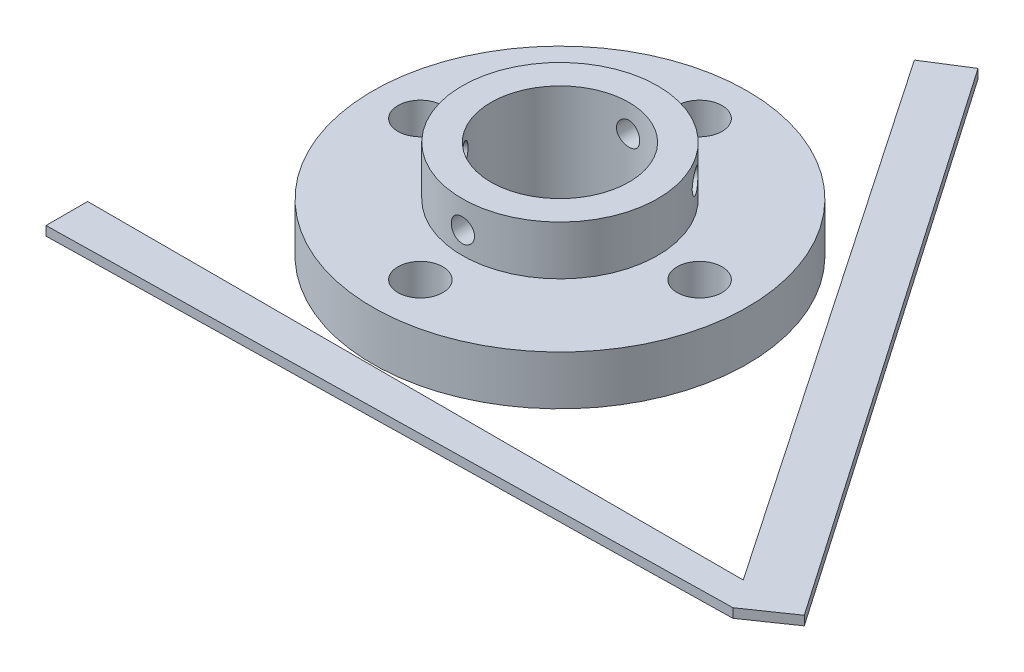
ISO-10303-21;
HEADER;
FILE_DESCRIPTION(('STEP AP214'),'2;1');
FILE_NAME('part.step','',(''),(''),'','','');
FILE_SCHEMA(('AUTOMOTIVE_DESIGN { 1 0 10303 214 1 1 1 1 }'));
ENDSEC;
DATA;
#1=APPLICATION_CONTEXT('core data for automotive mechanical design processes');
#2=APPLICATION_PROTOCOL_DEFINITION('international standard','automotive_design',2000,#1);
#3=PRODUCT_CONTEXT('',#1,'mechanical');
#4=PRODUCT('Part','Part','',(#3));
#5=PRODUCT_RELATED_PRODUCT_CATEGORY('part','',(#4));
#6=PRODUCT_DEFINITION_FORMATION('','',#4);
#7=PRODUCT_DEFINITION_CONTEXT('part definition',#1,'design');
#8=PRODUCT_DEFINITION('design','',#6,#7);
#9=PRODUCT_DEFINITION_SHAPE('','',#8);
#10=(LENGTH_UNIT() NAMED_UNIT(*) SI_UNIT(.MILLI.,.METRE.));
#11=(NAMED_UNIT(*) PLANE_ANGLE_UNIT() SI_UNIT($,.RADIAN.));
#12=(NAMED_UNIT(*) SI_UNIT($,.STERADIAN.) SOLID_ANGLE_UNIT());
#13=UNCERTAINTY_MEASURE_WITH_UNIT(LENGTH_MEASURE(1.E-05),#10,'distance_accuracy_value','');
#14=(GEOMETRIC_REPRESENTATION_CONTEXT(3) GLOBAL_UNCERTAINTY_ASSIGNED_CONTEXT((#13)) GLOBAL_UNIT_ASSIGNED_CONTEXT((#10,
#11,#12)) REPRESENTATION_CONTEXT('',''));
#15=CARTESIAN_POINT('',(0.,0.,0.));
#16=DIRECTION('',(0.,0.,1.));
#17=DIRECTION('',(1.,0.,0.));
#18=AXIS2_PLACEMENT_3D('',#15,#16,#17);
#19=CARTESIAN_POINT('',(-59.5297098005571,2.,52.0941340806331));
#20=DIRECTION('',(1.,0.,0.));
#21=DIRECTION('',(0.,0.,-1.));
#22=AXIS2_PLACEMENT_3D('',#19,#20,#21);
#23=PLANE('',#22);
#24=DIRECTION('',(0.,0.,1.));
#25=VECTOR('',#24,1.);
#26=CARTESIAN_POINT('',(-59.5297098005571,0.,52.0941340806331));
#27=LINE('',#26,#25);
#28=CARTESIAN_POINT('',(-59.5297098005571,0.,43.0590980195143));
#29=VERTEX_POINT('',#28);
#30=CARTESIAN_POINT('',(-59.5297098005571,0.,52.0941340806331));
#31=VERTEX_POINT('',#30);
#32=EDGE_CURVE('E131',#29,#31,#27,.T.);
#33=ORIENTED_EDGE('',*,*,#32,.T.);
#34=DIRECTION('',(0.,-1.,0.));
#35=VECTOR('',#34,1.);
#36=CARTESIAN_POINT('',(-59.5297098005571,2.,52.0941340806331));
#37=LINE('',#36,#35);
#38=CARTESIAN_POINT('',(-59.5297098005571,2.,52.0941340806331));
#39=VERTEX_POINT('',#38);
#40=EDGE_CURVE('E12',#39,#31,#37,.T.);
#41=ORIENTED_EDGE('',*,*,#40,.F.);
#42=DIRECTION('',(0.,0.,1.));
#43=VECTOR('',#42,1.);
#44=CARTESIAN_POINT('',(-59.5297098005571,2.,52.0941340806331));
#45=LINE('',#44,#43);
#46=CARTESIAN_POINT('',(-59.5297098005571,2.,43.0590980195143));
#47=VERTEX_POINT('',#46);
#48=EDGE_CURVE('E143',#47,#39,#45,.T.);
#49=ORIENTED_EDGE('',*,*,#48,.F.);
#50=DIRECTION('',(0.,-1.,0.));
#51=VECTOR('',#50,1.);
#52=CARTESIAN_POINT('',(-59.5297098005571,2.,43.0590980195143));
#53=LINE('',#52,#51);
#54=EDGE_CURVE('E127',#47,#29,#53,.T.);
#55=ORIENTED_EDGE('',*,*,#54,.T.);
#56=EDGE_LOOP('',(#33,#41,#49,#55));
#57=FACE_BOUND('',#56,.T.);
#58=ADVANCED_FACE('F41',(#57),#23,.F.);
#59=CARTESIAN_POINT('',(86.95153969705,2.,49.3849050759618));
#60=DIRECTION('',(-0.0184922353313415,0.,-0.999829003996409));
#61=DIRECTION('',(-0.999829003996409,0.,0.0184922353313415));
#62=AXIS2_PLACEMENT_3D('',#59,#60,#61);
#63=PLANE('',#62);
#64=DIRECTION('',(0.999829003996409,0.,-0.0184922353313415));
#65=VECTOR('',#64,1.);
#66=CARTESIAN_POINT('',(86.95153969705,0.,49.3849050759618));
#67=LINE('',#66,#65);
#68=CARTESIAN_POINT('',(86.95153969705,0.,49.3849050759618));
#69=VERTEX_POINT('',#68);
#70=EDGE_CURVE('E134',#31,#69,#67,.T.);
#71=ORIENTED_EDGE('',*,*,#70,.T.);
#72=DIRECTION('',(0.,-1.,0.));
#73=VECTOR('',#72,1.);
#74=CARTESIAN_POINT('',(86.95153969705,2.,49.3849050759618));
#75=LINE('',#74,#73);
#76=CARTESIAN_POINT('',(86.95153969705,2.,49.3849050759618));
#77=VERTEX_POINT('',#76);
#78=EDGE_CURVE('E49',#77,#69,#75,.T.);
#79=ORIENTED_EDGE('',*,*,#78,.F.);
#80=DIRECTION('',(0.999829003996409,0.,-0.0184922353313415));
#81=VECTOR('',#80,1.);
#82=CARTESIAN_POINT('',(86.95153969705,2.,49.3849050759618));
#83=LINE('',#82,#81);
#84=EDGE_CURVE('E97',#39,#77,#83,.T.);
#85=ORIENTED_EDGE('',*,*,#84,.F.);
#86=ORIENTED_EDGE('',*,*,#40,.T.);
#87=EDGE_LOOP('',(#71,#79,#85,#86));
#88=FACE_BOUND('',#87,.T.);
#89=ADVANCED_FACE('F168',(#88),#63,.F.);
#90=CARTESIAN_POINT('',(96.1187122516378,2.,43.0590980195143));
#91=DIRECTION('',(-0.567953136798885,0.,-0.823060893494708));
#92=DIRECTION('',(-0.823060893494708,0.,0.567953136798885));
#93=AXIS2_PLACEMENT_3D('',#90,#91,#92);
#94=PLANE('',#93);
#95=DIRECTION('',(0.823060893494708,0.,-0.567953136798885));
#96=VECTOR('',#95,1.);
#97=CARTESIAN_POINT('',(96.1187122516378,0.,43.0590980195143));
#98=LINE('',#97,#96);
#99=CARTESIAN_POINT('',(96.1187122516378,0.,43.0590980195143));
#100=VERTEX_POINT('',#99);
#101=EDGE_CURVE('E136',#69,#100,#98,.T.);
#102=ORIENTED_EDGE('',*,*,#101,.T.);
#103=DIRECTION('',(0.,-1.,0.));
#104=VECTOR('',#103,1.);
#105=CARTESIAN_POINT('',(96.1187122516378,2.,43.0590980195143));
#106=LINE('',#105,#104);
#107=CARTESIAN_POINT('',(96.1187122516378,2.,43.0590980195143));
#108=VERTEX_POINT('',#107);
#109=EDGE_CURVE('E147',#108,#100,#106,.T.);
#110=ORIENTED_EDGE('',*,*,#109,.F.);
#111=DIRECTION('',(0.823060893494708,0.,-0.567953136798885));
#112=VECTOR('',#111,1.);
#113=CARTESIAN_POINT('',(96.1187122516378,2.,43.0590980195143));
#114=LINE('',#113,#112);
#115=EDGE_CURVE('E155',#77,#108,#114,.T.);
#116=ORIENTED_EDGE('',*,*,#115,.F.);
#117=ORIENTED_EDGE('',*,*,#78,.T.);
#118=EDGE_LOOP('',(#102,#110,#116,#117));
#119=FACE_BOUND('',#118,.T.);
#120=ADVANCED_FACE('F153',(#119),#94,.F.);
#121=CARTESIAN_POINT('',(12.1255706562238,2.,-78.6612794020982));
#122=DIRECTION('',(-0.823060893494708,0.,0.567953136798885));
#123=DIRECTION('',(0.567953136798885,0.,0.823060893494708));
#124=AXIS2_PLACEMENT_3D('',#121,#122,#123);
#125=PLANE('',#124);
#126=DIRECTION('',(-0.567953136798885,0.,-0.823060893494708));
#127=VECTOR('',#126,1.);
#128=CARTESIAN_POINT('',(12.1255706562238,0.,-78.6612794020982));
#129=LINE('',#128,#127);
#130=CARTESIAN_POINT('',(12.1255706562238,0.,-78.6612794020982));
#131=VERTEX_POINT('',#130);
#132=EDGE_CURVE('E138',#100,#131,#129,.T.);
#133=ORIENTED_EDGE('',*,*,#132,.T.);
#134=DIRECTION('',(0.,-1.,0.));
#135=VECTOR('',#134,1.);
#136=CARTESIAN_POINT('',(12.1255706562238,2.,-78.6612794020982));
#137=LINE('',#136,#135);
#138=CARTESIAN_POINT('',(12.1255706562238,2.,-78.6612794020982));
#139=VERTEX_POINT('',#138);
#140=EDGE_CURVE('E122',#139,#131,#137,.T.);
#141=ORIENTED_EDGE('',*,*,#140,.F.);
#142=DIRECTION('',(-0.567953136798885,0.,-0.823060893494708));
#143=VECTOR('',#142,1.);
#144=CARTESIAN_POINT('',(12.1255706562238,2.,-78.6612794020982));
#145=LINE('',#144,#143);
#146=EDGE_CURVE('E113',#108,#139,#145,.T.);
#147=ORIENTED_EDGE('',*,*,#146,.F.);
#148=ORIENTED_EDGE('',*,*,#109,.T.);
#149=EDGE_LOOP('',(#133,#141,#147,#148));
#150=FACE_BOUND('',#149,.T.);
#151=ADVANCED_FACE('F161',(#150),#125,.F.);
#152=CARTESIAN_POINT('',(3.65345964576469,2.,-73.318725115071));
#153=DIRECTION('',(0.533403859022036,0.,0.845860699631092));
#154=DIRECTION('',(0.845860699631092,0.,-0.533403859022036));
#155=AXIS2_PLACEMENT_3D('',#152,#153,#154);
#156=PLANE('',#155);
#157=DIRECTION('',(-0.845860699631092,0.,0.533403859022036));
#158=VECTOR('',#157,1.);
#159=CARTESIAN_POINT('',(3.65345964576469,0.,-73.318725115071));
#160=LINE('',#159,#158);
#161=CARTESIAN_POINT('',(3.65345964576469,0.,-73.318725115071));
#162=VERTEX_POINT('',#161);
#163=EDGE_CURVE('E121',#131,#162,#160,.T.);
#164=ORIENTED_EDGE('',*,*,#163,.T.);
#165=DIRECTION('',(0.,-1.,0.));
#166=VECTOR('',#165,1.);
#167=CARTESIAN_POINT('',(3.65345964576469,2.,-73.318725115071));
#168=LINE('',#167,#166);
#169=CARTESIAN_POINT('',(3.65345964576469,2.,-73.318725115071));
#170=VERTEX_POINT('',#169);
#171=EDGE_CURVE('E118',#170,#162,#168,.T.);
#172=ORIENTED_EDGE('',*,*,#171,.F.);
#173=DIRECTION('',(-0.845860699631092,0.,0.533403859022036));
#174=VECTOR('',#173,1.);
#175=CARTESIAN_POINT('',(3.65345964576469,2.,-73.318725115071));
#176=LINE('',#175,#174);
#177=EDGE_CURVE('E107',#139,#170,#176,.T.);
#178=ORIENTED_EDGE('',*,*,#177,.F.);
#179=ORIENTED_EDGE('',*,*,#140,.T.);
#180=EDGE_LOOP('',(#164,#172,#178,#179));
#181=FACE_BOUND('',#180,.T.);
#182=ADVANCED_FACE('F119',(#181),#156,.F.);
#183=CARTESIAN_POINT('',(82.8647125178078,2.,43.0590980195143));
#184=DIRECTION('',(0.826680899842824,0.,-0.562671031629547));
#185=DIRECTION('',(-0.562671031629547,0.,-0.826680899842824));
#186=AXIS2_PLACEMENT_3D('',#183,#184,#185);
#187=PLANE('',#186);
#188=DIRECTION('',(0.562671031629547,0.,0.826680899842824));
#189=VECTOR('',#188,1.);
#190=CARTESIAN_POINT('',(82.8647125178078,0.,43.0590980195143));
#191=LINE('',#190,#189);
#192=CARTESIAN_POINT('',(82.8647125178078,0.,43.0590980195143));
#193=VERTEX_POINT('',#192);
#194=EDGE_CURVE('E83',#162,#193,#191,.T.);
#195=ORIENTED_EDGE('',*,*,#194,.T.);
#196=DIRECTION('',(0.,-1.,0.));
#197=VECTOR('',#196,1.);
#198=CARTESIAN_POINT('',(82.8647125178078,2.,43.0590980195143));
#199=LINE('',#198,#197);
#200=CARTESIAN_POINT('',(82.8647125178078,2.,43.0590980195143));
#201=VERTEX_POINT('',#200);
#202=EDGE_CURVE('E123',#201,#193,#199,.T.);
#203=ORIENTED_EDGE('',*,*,#202,.F.);
#204=DIRECTION('',(0.562671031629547,0.,0.826680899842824));
#205=VECTOR('',#204,1.);
#206=CARTESIAN_POINT('',(82.8647125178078,2.,43.0590980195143));
#207=LINE('',#206,#205);
#208=EDGE_CURVE('E111',#170,#201,#207,.T.);
#209=ORIENTED_EDGE('',*,*,#208,.F.);
#210=ORIENTED_EDGE('',*,*,#171,.T.);
#211=EDGE_LOOP('',(#195,#203,#209,#210));
#212=FACE_BOUND('',#211,.T.);
#213=ADVANCED_FACE('F125',(#212),#187,.F.);
#214=CARTESIAN_POINT('',(-59.5297098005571,2.,43.0590980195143));
#215=DIRECTION('',(0.,0.,1.));
#216=DIRECTION('',(1.,0.,0.));
#217=AXIS2_PLACEMENT_3D('',#214,#215,#216);
#218=PLANE('',#217);
#219=DIRECTION('',(-1.,0.,0.));
#220=VECTOR('',#219,1.);
#221=CARTESIAN_POINT('',(-59.5297098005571,0.,43.0590980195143));
#222=LINE('',#221,#220);
#223=EDGE_CURVE('E89',#193,#29,#222,.T.);
#224=ORIENTED_EDGE('',*,*,#223,.T.);
#225=ORIENTED_EDGE('',*,*,#54,.F.);
#226=DIRECTION('',(-1.,0.,0.));
#227=VECTOR('',#226,1.);
#228=CARTESIAN_POINT('',(-59.5297098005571,2.,43.0590980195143));
#229=LINE('',#228,#227);
#230=EDGE_CURVE('E57',#201,#47,#229,.T.);
#231=ORIENTED_EDGE('',*,*,#230,.F.);
#232=ORIENTED_EDGE('',*,*,#202,.T.);
#233=EDGE_LOOP('',(#224,#225,#231,#232));
#234=FACE_BOUND('',#233,.T.);
#235=ADVANCED_FACE('F182',(#234),#218,.F.);
#236=CARTESIAN_POINT('',(0.,2.,0.));
#237=DIRECTION('',(0.,-1.,0.));
#238=DIRECTION('',(0.,0.,-1.));
#239=AXIS2_PLACEMENT_3D('',#236,#237,#238);
#240=PLANE('',#239);
#241=ORIENTED_EDGE('',*,*,#48,.T.);
#242=ORIENTED_EDGE('',*,*,#84,.T.);
#243=ORIENTED_EDGE('',*,*,#115,.T.);
#244=ORIENTED_EDGE('',*,*,#146,.T.);
#245=ORIENTED_EDGE('',*,*,#177,.T.);
#246=ORIENTED_EDGE('',*,*,#208,.T.);
#247=ORIENTED_EDGE('',*,*,#230,.T.);
#248=EDGE_LOOP('',(#241,#242,#243,#244,#245,#246,#247));
#249=FACE_BOUND('',#248,.T.);
#250=ADVANCED_FACE('F109',(#249),#240,.F.);
#251=CARTESIAN_POINT('',(0.,0.,0.));
#252=DIRECTION('',(0.,-1.,0.));
#253=DIRECTION('',(0.,0.,-1.));
#254=AXIS2_PLACEMENT_3D('',#251,#252,#253);
#255=PLANE('',#254);
#256=ORIENTED_EDGE('',*,*,#32,.F.);
#257=ORIENTED_EDGE('',*,*,#223,.F.);
#258=ORIENTED_EDGE('',*,*,#194,.F.);
#259=ORIENTED_EDGE('',*,*,#163,.F.);
#260=ORIENTED_EDGE('',*,*,#132,.F.);
#261=ORIENTED_EDGE('',*,*,#101,.F.);
#262=ORIENTED_EDGE('',*,*,#70,.F.);
#263=EDGE_LOOP('',(#256,#257,#258,#259,#260,#261,#262));
#264=FACE_BOUND('',#263,.T.);
#265=ADVANCED_FACE('F159',(#264),#255,.T.);
#266=CLOSED_SHELL('',(#58,#89,#120,#151,#182,#213,#235,#250,#265));
#267=MANIFOLD_SOLID_BREP('B2',#266);
#268=CARTESIAN_POINT('',(0.,0.,0.));
#269=DIRECTION('',(0.,-1.,0.));
#270=DIRECTION('',(0.,0.,-1.));
#271=AXIS2_PLACEMENT_3D('',#268,#269,#270);
#272=CYLINDRICAL_SURFACE('',#271,21.2347326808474);
#273=CARTESIAN_POINT('',(-18.7492110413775,16.8730825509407,9.96899981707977));
#274=CARTESIAN_POINT('',(-18.7492092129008,16.7363140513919,9.96900567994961));
#275=CARTESIAN_POINT('',(-18.7437741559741,16.5994579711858,9.97924612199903));
#276=CARTESIAN_POINT('',(-18.7220854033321,16.3295484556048,10.0198752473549));
#277=CARTESIAN_POINT('',(-18.7058201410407,16.1964992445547,10.0502854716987));
#278=CARTESIAN_POINT('',(-18.6626825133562,15.9381507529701,10.1301629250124));
#279=CARTESIAN_POINT('',(-18.6358170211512,15.8128465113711,10.1796178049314));
#280=CARTESIAN_POINT('',(-18.5718419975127,15.5734335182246,10.2958699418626));
#281=CARTESIAN_POINT('',(-18.5347343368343,15.4593227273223,10.3626640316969));
#282=CARTESIAN_POINT('',(-18.4506271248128,15.2449670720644,10.5116868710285));
#283=CARTESIAN_POINT('',(-18.4035862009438,15.1447832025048,10.5939800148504));
#284=CARTESIAN_POINT('',(-18.300465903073,14.9616514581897,10.7711328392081));
#285=CARTESIAN_POINT('',(-18.2443860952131,14.8787044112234,10.8659931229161));
#286=CARTESIAN_POINT('',(-18.1240496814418,14.7321850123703,11.06554506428));
#287=CARTESIAN_POINT('',(-18.0597706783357,14.6686674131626,11.1702634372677));
#288=CARTESIAN_POINT('',(-17.9245182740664,14.5631604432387,11.3860313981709));
#289=CARTESIAN_POINT('',(-17.8535450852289,14.5211703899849,11.4970807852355));
#290=CARTESIAN_POINT('',(-17.7069342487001,14.4600914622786,11.7216142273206));
#291=CARTESIAN_POINT('',(-17.6313187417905,14.4409016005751,11.8350852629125));
#292=CARTESIAN_POINT('',(-17.4771519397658,14.4256550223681,12.0615834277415));
#293=CARTESIAN_POINT('',(-17.3986007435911,14.4295975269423,12.1746105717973));
#294=CARTESIAN_POINT('',(-17.2412212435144,14.460422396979,12.3964744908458));
#295=CARTESIAN_POINT('',(-17.162396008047,14.487196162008,12.5053285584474));
#296=CARTESIAN_POINT('',(-17.0065352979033,14.5627540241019,12.7164798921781));
#297=CARTESIAN_POINT('',(-16.9294998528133,14.6115384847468,12.8187770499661));
#298=CARTESIAN_POINT('',(-16.7795623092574,14.7298499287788,13.014430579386));
#299=CARTESIAN_POINT('',(-16.7066701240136,14.7994243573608,13.1077658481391));
#300=CARTESIAN_POINT('',(-16.5677115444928,14.9573062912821,13.2829714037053));
#301=CARTESIAN_POINT('',(-16.50164541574,15.0456145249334,13.3648412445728));
#302=CARTESIAN_POINT('',(-16.378350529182,15.2390666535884,13.5156601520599));
#303=CARTESIAN_POINT('',(-16.321175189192,15.3443051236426,13.5845316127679));
#304=CARTESIAN_POINT('',(-16.2182885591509,15.5683042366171,13.7072031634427));
#305=CARTESIAN_POINT('',(-16.1725772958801,15.6870649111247,13.7610032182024));
#306=CARTESIAN_POINT('',(-16.0944080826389,15.934816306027,13.8523475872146));
#307=CARTESIAN_POINT('',(-16.0619544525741,16.0638103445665,13.8898866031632));
#308=CARTESIAN_POINT('',(-16.0116524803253,16.3283265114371,13.9478436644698));
#309=CARTESIAN_POINT('',(-15.99380354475,16.4638483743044,13.9682624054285));
#310=CARTESIAN_POINT('',(-15.9735174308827,16.7367432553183,13.9914564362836));
#311=CARTESIAN_POINT('',(-15.970992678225,16.8741012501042,13.9943319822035));
#312=CARTESIAN_POINT('',(-15.9812269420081,17.147497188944,13.9826433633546));
#313=CARTESIAN_POINT('',(-15.9939856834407,17.2835351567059,13.9680795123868));
#314=CARTESIAN_POINT('',(-16.0341956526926,17.5500376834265,13.9219023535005));
#315=CARTESIAN_POINT('',(-16.0616052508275,17.6805169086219,13.8903373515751));
#316=CARTESIAN_POINT('',(-16.1299760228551,17.9326556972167,13.8108825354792));
#317=CARTESIAN_POINT('',(-16.1709376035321,18.0543149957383,13.7629922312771));
#318=CARTESIAN_POINT('',(-16.2650138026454,18.2859607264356,13.651685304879));
#319=CARTESIAN_POINT('',(-16.3181821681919,18.3958922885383,13.5881999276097));
#320=CARTESIAN_POINT('',(-16.4345442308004,18.6004035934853,13.4472287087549));
#321=CARTESIAN_POINT('',(-16.497738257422,18.694982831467,13.3697424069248));
#322=CARTESIAN_POINT('',(-16.6321677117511,18.8665657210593,13.2021378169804));
#323=CARTESIAN_POINT('',(-16.7034403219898,18.9434827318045,13.1119606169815));
#324=CARTESIAN_POINT('',(-16.8512590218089,19.076959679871,12.9214340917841));
#325=CARTESIAN_POINT('',(-16.927805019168,19.1335199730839,12.8210849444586));
#326=CARTESIAN_POINT('',(-17.0834033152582,19.2245332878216,12.6130102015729));
#327=CARTESIAN_POINT('',(-17.1624493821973,19.2590373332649,12.5053022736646));
#328=CARTESIAN_POINT('',(-17.3206881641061,19.3051249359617,12.285194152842));
#329=CARTESIAN_POINT('',(-17.3998808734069,19.3167093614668,12.1727941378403));
#330=CARTESIAN_POINT('',(-17.5555899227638,19.3166143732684,11.9471260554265));
#331=CARTESIAN_POINT('',(-17.6321190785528,19.305068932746,11.8338667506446));
#332=CARTESIAN_POINT('',(-17.7808948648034,19.2593245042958,11.6091264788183));
#333=CARTESIAN_POINT('',(-17.8531414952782,19.2251255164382,11.4976455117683));
#334=CARTESIAN_POINT('',(-17.9915602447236,19.135084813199,11.2798180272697));
#335=CARTESIAN_POINT('',(-18.0577338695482,19.079248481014,11.1734702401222));
#336=CARTESIAN_POINT('',(-18.1825899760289,18.9475320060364,10.9691225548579));
#337=CARTESIAN_POINT('',(-18.2412724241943,18.8716517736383,10.8711226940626));
#338=CARTESIAN_POINT('',(-18.3503331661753,18.7015025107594,10.6860081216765));
#339=CARTESIAN_POINT('',(-18.4006635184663,18.6071336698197,10.5989569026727));
#340=CARTESIAN_POINT('',(-18.4917828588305,18.4028903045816,10.4391724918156));
#341=CARTESIAN_POINT('',(-18.5325695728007,18.2930120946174,10.3664427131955));
#342=CARTESIAN_POINT('',(-18.6040908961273,18.0604607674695,10.237535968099));
#343=CARTESIAN_POINT('',(-18.6347919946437,17.9377467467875,10.1814142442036));
#344=CARTESIAN_POINT('',(-18.6855080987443,17.6833723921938,10.0880378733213));
#345=CARTESIAN_POINT('',(-18.7055349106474,17.5517221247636,10.0507623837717));
#346=CARTESIAN_POINT('',(-18.7297938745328,17.3283157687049,10.0054530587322));
#347=CARTESIAN_POINT('',(-18.7370701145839,17.2379774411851,9.99180581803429));
#348=CARTESIAN_POINT('',(-18.7467792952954,17.0561333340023,9.97357726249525));
#349=CARTESIAN_POINT('',(-18.7492122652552,16.964627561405,9.96899589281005));
#350=CARTESIAN_POINT('',(-18.7492110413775,16.8730825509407,9.96899981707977));
#351=B_SPLINE_CURVE_WITH_KNOTS('',3,(#273,#274,#275,#276,#277,#278,#279,#280,#281,#282,#283,
#284,#285,#286,#287,#288,#289,#290,#291,#292,#293,#294,#295,#296,#297,#298,#299,#300,#301,#302,
#303,#304,#305,#306,#307,#308,#309,#310,#311,#312,#313,#314,#315,#316,#317,#318,#319,#320,#321,
#322,#323,#324,#325,#326,#327,#328,#329,#330,#331,#332,#333,#334,#335,#336,#337,#338,#339,#340,
#341,#342,#343,#344,#345,#346,#347,#348,#349,#350),.UNSPECIFIED.,.T.,.F.,(4,2,2,2,2,2,2,2,2,2,2,
2,2,2,2,2,2,2,2,2,2,2,2,2,2,2,2,2,2,2,2,2,2,2,2,2,2,2,4),(0.,0.40997112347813,0.820380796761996,
1.23052479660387,1.64059393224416,2.05240595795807,2.4642377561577,2.87721963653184,
3.29018842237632,3.70132117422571,4.1124400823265,4.52161427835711,4.93079523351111,
5.34091721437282,5.75105514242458,6.16356924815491,6.57608431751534,6.98873369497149,
7.401366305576,7.81163857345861,8.22190345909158,8.63100874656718,9.04012631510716,
9.45108102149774,9.86204923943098,10.2749923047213,10.6879281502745,11.0999052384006,
11.5118667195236,11.9214489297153,12.3310311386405,12.7405115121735,13.1499937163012,
13.5617506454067,13.9736055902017,14.3868154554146,14.7995673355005,15.0739802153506,
15.3483914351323),.UNSPECIFIED.);
#352=CARTESIAN_POINT('',(-18.7492110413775,16.8730825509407,9.96899981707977));
#353=VERTEX_POINT('',#352);
#354=EDGE_CURVE('E276',#353,#353,#351,.T.);
#355=ORIENTED_EDGE('',*,*,#354,.F.);
#356=EDGE_LOOP('',(#355));
#357=FACE_BOUND('',#356,.T.);
#358=CARTESIAN_POINT('',(15.9735339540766,16.8730825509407,-13.991428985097));
#359=CARTESIAN_POINT('',(15.9735387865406,17.0098510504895,-13.9914251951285));
#360=CARTESIAN_POINT('',(15.9811841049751,17.1467071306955,-13.9827099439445));
#361=CARTESIAN_POINT('',(16.0114726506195,17.4166166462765,-13.9480151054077));
#362=CARTESIAN_POINT('',(16.0341319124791,17.5496658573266,-13.9220170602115));
#363=CARTESIAN_POINT('',(16.0935031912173,17.8080143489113,-13.8533416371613));
#364=CARTESIAN_POINT('',(16.1302061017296,17.9333185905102,-13.8106750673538));
#365=CARTESIAN_POINT('',(16.2161904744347,18.1727315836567,-13.70961048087));
#366=CARTESIAN_POINT('',(16.2654696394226,18.286842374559,-13.6512153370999));
#367=CARTESIAN_POINT('',(16.3749479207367,18.501198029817,-13.519699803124));
#368=CARTESIAN_POINT('',(16.4351925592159,18.6013818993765,-13.4465178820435));
#369=CARTESIAN_POINT('',(16.5642231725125,18.7845136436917,-13.2872444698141));
#370=CARTESIAN_POINT('',(16.6330095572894,18.867460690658,-13.201152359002));
#371=CARTESIAN_POINT('',(16.7768722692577,19.013980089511,-13.0178347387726));
#372=CARTESIAN_POINT('',(16.8519656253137,19.0774976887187,-12.9205788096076));
#373=CARTESIAN_POINT('',(17.0056959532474,19.1830046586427,-12.7175615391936));
#374=CARTESIAN_POINT('',(17.0843328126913,19.2249947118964,-12.6118004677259));
#375=CARTESIAN_POINT('',(17.2422275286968,19.2860736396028,-12.3950534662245));
#376=CARTESIAN_POINT('',(17.3214810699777,19.3052635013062,-12.2840928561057));
#377=CARTESIAN_POINT('',(17.4785313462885,19.3205100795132,-12.0595844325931));
#378=CARTESIAN_POINT('',(17.5563281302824,19.316567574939,-11.946036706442));
#379=CARTESIAN_POINT('',(17.7079057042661,19.2857427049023,-11.7201691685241));
#380=CARTESIAN_POINT('',(17.7817037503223,19.2589689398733,-11.6078460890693));
#381=CARTESIAN_POINT('',(17.9238048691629,19.1834110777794,-11.3871999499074));
#382=CARTESIAN_POINT('',(17.992107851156,19.1346266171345,-11.278876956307));
#383=CARTESIAN_POINT('',(18.1218216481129,19.0163151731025,-11.0692680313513));
#384=CARTESIAN_POINT('',(18.1832162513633,18.9467407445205,-10.9679988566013));
#385=CARTESIAN_POINT('',(18.2977088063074,18.7888588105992,-10.7759105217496));
#386=CARTESIAN_POINT('',(18.350806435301,18.7005505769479,-10.6850917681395));
#387=CARTESIAN_POINT('',(18.4480578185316,18.5070984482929,-10.5163015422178));
#388=CARTESIAN_POINT('',(18.4921579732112,18.4018599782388,-10.4384075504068));
#389=CARTESIAN_POINT('',(18.5703358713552,18.1778608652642,-10.2986857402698));
#390=CARTESIAN_POINT('',(18.6044135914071,18.0591001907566,-10.2368579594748));
#391=CARTESIAN_POINT('',(18.6620742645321,17.8113487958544,-10.1313616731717));
#392=CARTESIAN_POINT('',(18.6856537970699,17.6823547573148,-10.0876990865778));
#393=CARTESIAN_POINT('',(18.721988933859,17.4178385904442,-10.0201042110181));
#394=CARTESIAN_POINT('',(18.7347449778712,17.2823167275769,-9.99617112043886));
#395=CARTESIAN_POINT('',(18.7492308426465,17.009421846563,-9.96897462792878));
#396=CARTESIAN_POINT('',(18.7510233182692,16.8720638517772,-9.96559377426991));
#397=CARTESIAN_POINT('',(18.7437271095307,16.5986679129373,-9.97930979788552));
#398=CARTESIAN_POINT('',(18.7346386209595,16.4626299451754,-9.99640630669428));
#399=CARTESIAN_POINT('',(18.7057355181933,16.1961274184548,-10.050385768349));
#400=CARTESIAN_POINT('',(18.6859512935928,16.0656481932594,-10.0872126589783));
#401=CARTESIAN_POINT('',(18.6359293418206,15.8135094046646,-10.1793290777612));
#402=CARTESIAN_POINT('',(18.6056913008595,15.6918501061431,-10.2346191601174));
#403=CARTESIAN_POINT('',(18.5350119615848,15.4602043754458,-10.3620710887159));
#404=CARTESIAN_POINT('',(18.494525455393,15.350272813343,-10.4343075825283));
#405=CARTESIAN_POINT('',(18.4040207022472,15.1457615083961,-10.5931216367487));
#406=CARTESIAN_POINT('',(18.3540021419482,15.0511822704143,-10.6796996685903));
#407=CARTESIAN_POINT('',(18.2450086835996,14.879599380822,-10.8648563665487));
#408=CARTESIAN_POINT('',(18.185991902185,14.8026823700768,-10.9634907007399));
#409=CARTESIAN_POINT('',(18.0603195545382,14.6692054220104,-11.1692993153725));
#410=CARTESIAN_POINT('',(17.9936641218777,14.6126451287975,-11.2764734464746));
#411=CARTESIAN_POINT('',(17.8543462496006,14.5216318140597,-11.4957824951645));
#412=CARTESIAN_POINT('',(17.7816981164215,14.4871277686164,-11.6079053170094));
#413=CARTESIAN_POINT('',(17.6320669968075,14.4410401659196,-11.8339531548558));
#414=CARTESIAN_POINT('',(17.5550841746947,14.4294557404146,-11.9478781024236));
#415=CARTESIAN_POINT('',(17.3993572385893,14.4295507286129,-12.1735338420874));
#416=CARTESIAN_POINT('',(17.3206258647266,14.4410961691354,-12.2852735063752));
#417=CARTESIAN_POINT('',(17.163306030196,14.4868405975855,-12.504117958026));
#418=CARTESIAN_POINT('',(17.0847175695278,14.5210395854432,-12.6112227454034));
#419=CARTESIAN_POINT('',(16.9301853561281,14.6110802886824,-12.8179311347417));
#420=CARTESIAN_POINT('',(16.854240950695,14.6669166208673,-12.9175365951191));
#421=CARTESIAN_POINT('',(16.7074984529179,14.7986330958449,-13.1067815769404));
#422=CARTESIAN_POINT('',(16.6367003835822,14.874513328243,-13.1964210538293));
#423=CARTESIAN_POINT('',(16.5023341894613,15.0446625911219,-13.3640735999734));
#424=CARTESIAN_POINT('',(16.4388084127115,15.1390314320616,-13.4420193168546));
#425=CARTESIAN_POINT('',(16.3217572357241,15.3432747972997,-13.5839094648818));
#426=CARTESIAN_POINT('',(16.2682342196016,15.4531530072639,-13.6478505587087));
#427=CARTESIAN_POINT('',(16.1730966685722,15.6857043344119,-13.7604609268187));
#428=CARTESIAN_POINT('',(16.1315218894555,15.8084183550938,-13.8090792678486));
#429=CARTESIAN_POINT('',(16.0622194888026,16.0627927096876,-13.8896301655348));
#430=CARTESIAN_POINT('',(16.0344765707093,16.1944429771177,-13.9215811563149));
#431=CARTESIAN_POINT('',(16.0007244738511,16.4178493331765,-13.9603397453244));
#432=CARTESIAN_POINT('',(15.9905474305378,16.5081876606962,-13.9719852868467));
#433=CARTESIAN_POINT('',(15.9769505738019,16.6900317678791,-13.9875311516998));
#434=CARTESIAN_POINT('',(15.9735307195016,16.7815375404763,-13.9914315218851));
#435=CARTESIAN_POINT('',(15.9735339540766,16.8730825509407,-13.991428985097));
#436=B_SPLINE_CURVE_WITH_KNOTS('',3,(#358,#359,#360,#361,#362,#363,#364,#365,#366,#367,#368,
#369,#370,#371,#372,#373,#374,#375,#376,#377,#378,#379,#380,#381,#382,#383,#384,#385,#386,#387,
#388,#389,#390,#391,#392,#393,#394,#395,#396,#397,#398,#399,#400,#401,#402,#403,#404,#405,#406,
#407,#408,#409,#410,#411,#412,#413,#414,#415,#416,#417,#418,#419,#420,#421,#422,#423,#424,#425,
#426,#427,#428,#429,#430,#431,#432,#433,#434,#435),.UNSPECIFIED.,.T.,.F.,(4,2,2,2,2,2,2,2,2,2,2,
2,2,2,2,2,2,2,2,2,2,2,2,2,2,2,2,2,2,2,2,2,2,2,2,2,2,2,4),(0.,0.40997112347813,0.820380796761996,
1.23052479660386,1.64059393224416,2.05240595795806,2.46423775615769,2.87721963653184,
3.29018842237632,3.70132117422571,4.11244008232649,4.52161427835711,4.93079523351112,
5.34091721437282,5.75105514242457,6.16356924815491,6.57608431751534,6.98873369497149,
7.40136630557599,7.81163857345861,8.22190345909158,8.63100874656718,9.04012631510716,
9.45108102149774,9.86204923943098,10.2749923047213,10.6879281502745,11.0999052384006,
11.5118667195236,11.9214489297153,12.3310311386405,12.7405115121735,13.1499937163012,
13.5617506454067,13.9736055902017,14.3868154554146,14.7995673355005,15.0739802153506,
15.3483914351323),.UNSPECIFIED.);
#437=CARTESIAN_POINT('',(15.9735339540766,16.8730825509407,-13.991428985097));
#438=VERTEX_POINT('',#437);
#439=EDGE_CURVE('E318',#438,#438,#436,.T.);
#440=ORIENTED_EDGE('',*,*,#439,.F.);
#441=EDGE_LOOP('',(#440));
#442=FACE_BOUND('',#441,.T.);
#443=CARTESIAN_POINT('',(-2.52710094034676,15.4740567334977,21.0838239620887));
#444=CARTESIAN_POINT('',(-2.5270948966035,15.6154647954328,21.0838259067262));
#445=CARTESIAN_POINT('',(-2.5151918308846,15.7569625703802,21.0852619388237));
#446=CARTESIAN_POINT('',(-2.46789416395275,16.0360240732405,21.0908490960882));
#447=CARTESIAN_POINT('',(-2.43247466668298,16.1735834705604,21.0950030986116));
#448=CARTESIAN_POINT('',(-2.33919974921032,16.4406872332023,21.1055491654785));
#449=CARTESIAN_POINT('',(-2.2813591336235,16.570236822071,21.1119397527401));
#450=CARTESIAN_POINT('',(-2.1449147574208,16.8177651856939,21.1262371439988));
#451=CARTESIAN_POINT('',(-2.06631469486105,16.935746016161,21.1341436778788));
#452=CARTESIAN_POINT('',(-1.89015406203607,17.1574130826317,21.1506271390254));
#453=CARTESIAN_POINT('',(-1.79250904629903,17.2610320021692,21.1592069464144));
#454=CARTESIAN_POINT('',(-1.58121182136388,17.4504528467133,21.1760442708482));
#455=CARTESIAN_POINT('',(-1.46755883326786,17.5362539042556,21.1843017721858));
#456=CARTESIAN_POINT('',(-1.22705108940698,17.6878429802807,21.1995933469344));
#457=CARTESIAN_POINT('',(-1.10015786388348,17.753570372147,21.2066236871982));
#458=CARTESIAN_POINT('',(-0.837037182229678,17.8627581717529,21.2186372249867));
#459=CARTESIAN_POINT('',(-0.700810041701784,17.9062193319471,21.2236204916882));
#460=CARTESIAN_POINT('',(-0.423575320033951,17.969440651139,21.2309581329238));
#461=CARTESIAN_POINT('',(-0.282593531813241,17.9893124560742,21.2333248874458));
#462=CARTESIAN_POINT('',(0.000722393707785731,18.0051368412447,21.2352050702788));
#463=CARTESIAN_POINT('',(0.143056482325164,18.0010902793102,21.2347186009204));
#464=CARTESIAN_POINT('',(0.424277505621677,17.9692825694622,21.2309571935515));
#465=CARTESIAN_POINT('',(0.563178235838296,17.9416414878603,21.2276963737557));
#466=CARTESIAN_POINT('',(0.834355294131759,17.8636168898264,21.2187685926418));
#467=CARTESIAN_POINT('',(0.966631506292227,17.8132329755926,21.2131015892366));
#468=CARTESIAN_POINT('',(1.22117815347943,17.6910242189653,21.1999739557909));
#469=CARTESIAN_POINT('',(1.34342326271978,17.6191471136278,21.1925089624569));
#470=CARTESIAN_POINT('',(1.57416132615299,17.4560302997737,21.176621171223));
#471=CARTESIAN_POINT('',(1.68265370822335,17.3647897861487,21.1681983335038));
#472=CARTESIAN_POINT('',(1.883511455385,17.16486293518,21.1512765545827));
#473=CARTESIAN_POINT('',(1.97577273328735,17.0560720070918,21.1427774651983));
#474=CARTESIAN_POINT('',(2.14074116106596,16.8244926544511,21.126712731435));
#475=CARTESIAN_POINT('',(2.21344825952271,16.7017041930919,21.1191470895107));
#476=CARTESIAN_POINT('',(2.33724870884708,16.4455258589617,21.1058057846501));
#477=CARTESIAN_POINT('',(2.38833421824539,16.3121321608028,21.1000307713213));
#478=CARTESIAN_POINT('',(2.46735164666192,16.0385758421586,21.090937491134));
#479=CARTESIAN_POINT('',(2.49528457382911,15.8984135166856,21.0876191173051));
#480=CARTESIAN_POINT('',(2.52706710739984,15.6162164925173,21.0838341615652));
#481=CARTESIAN_POINT('',(2.53106297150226,15.4741984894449,21.0833502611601));
#482=CARTESIAN_POINT('',(2.51524338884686,15.1915167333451,21.0852432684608));
#483=CARTESIAN_POINT('',(2.49542840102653,15.0508529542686,21.0876201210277));
#484=CARTESIAN_POINT('',(2.43267253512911,14.775307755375,21.0949510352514));
#485=CARTESIAN_POINT('',(2.38980204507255,14.6404100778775,21.0998972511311));
#486=CARTESIAN_POINT('',(2.28222441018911,14.3797185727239,21.1118032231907));
#487=CARTESIAN_POINT('',(2.21751656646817,14.2539250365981,21.1187630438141));
#488=CARTESIAN_POINT('',(2.06773968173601,14.0143496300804,21.1339536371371));
#489=CARTESIAN_POINT('',(1.9825744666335,13.9006282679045,21.1421903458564));
#490=CARTESIAN_POINT('',(1.79443680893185,13.689041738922,21.1589878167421));
#491=CARTESIAN_POINT('',(1.69146373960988,13.5911771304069,21.1675485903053));
#492=CARTESIAN_POINT('',(1.46999562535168,13.4135707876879,21.1840825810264));
#493=CARTESIAN_POINT('',(1.35142337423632,13.3339249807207,21.1920525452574));
#494=CARTESIAN_POINT('',(1.10249970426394,13.1956798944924,21.2064586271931));
#495=CARTESIAN_POINT('',(0.972148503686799,13.1370802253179,21.2128947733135));
#496=CARTESIAN_POINT('',(0.703690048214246,13.0427503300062,21.2234935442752));
#497=CARTESIAN_POINT('',(0.565602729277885,13.0069640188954,21.2276617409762));
#498=CARTESIAN_POINT('',(0.285326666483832,12.9590940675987,21.2332780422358));
#499=CARTESIAN_POINT('',(0.143138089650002,12.9470094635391,21.2347262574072));
#500=CARTESIAN_POINT('',(-0.140366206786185,12.9469028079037,21.2347390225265));
#501=CARTESIAN_POINT('',(-0.281681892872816,12.9587325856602,21.2333213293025));
#502=CARTESIAN_POINT('',(-0.56030197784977,13.0058058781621,21.2277967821));
#503=CARTESIAN_POINT('',(-0.697606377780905,13.0410493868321,21.2236899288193));
#504=CARTESIAN_POINT('',(-0.964291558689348,13.1339045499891,21.2132466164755));
#505=CARTESIAN_POINT('',(-1.09367459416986,13.1915098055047,21.2069107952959));
#506=CARTESIAN_POINT('',(-1.34096033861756,13.3274378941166,21.1927123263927));
#507=CARTESIAN_POINT('',(-1.45886296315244,13.4057608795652,21.1848496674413));
#508=CARTESIAN_POINT('',(-1.68059890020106,13.5814516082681,21.1684178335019));
#509=CARTESIAN_POINT('',(-1.78434449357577,13.6789296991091,21.159844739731));
#510=CARTESIAN_POINT('',(-1.97406511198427,13.8899362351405,21.1429902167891));
#511=CARTESIAN_POINT('',(-2.06003590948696,14.0034684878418,21.1347088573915));
#512=CARTESIAN_POINT('',(-2.21202046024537,14.2438133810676,21.1193444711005));
#513=CARTESIAN_POINT('',(-2.27796313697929,14.3706712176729,21.1122657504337));
#514=CARTESIAN_POINT('',(-2.38751738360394,14.6336705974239,21.1001587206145));
#515=CARTESIAN_POINT('',(-2.4311534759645,14.7698017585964,21.0951281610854));
#516=CARTESIAN_POINT('',(-2.48429531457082,15.0012223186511,21.0889208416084));
#517=CARTESIAN_POINT('',(-2.50032464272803,15.0950464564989,21.0870189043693));
#518=CARTESIAN_POINT('',(-2.52172945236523,15.2839191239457,21.0844698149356));
#519=CARTESIAN_POINT('',(-2.5271050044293,15.3789676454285,21.0838226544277));
#520=CARTESIAN_POINT('',(-2.52710094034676,15.4740567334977,21.0838239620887));
#521=B_SPLINE_CURVE_WITH_KNOTS('',3,(#443,#444,#445,#446,#447,#448,#449,#450,#451,#452,#453,
#454,#455,#456,#457,#458,#459,#460,#461,#462,#463,#464,#465,#466,#467,#468,#469,#470,#471,#472,
#473,#474,#475,#476,#477,#478,#479,#480,#481,#482,#483,#484,#485,#486,#487,#488,#489,#490,#491,
#492,#493,#494,#495,#496,#497,#498,#499,#500,#501,#502,#503,#504,#505,#506,#507,#508,#509,#510,
#511,#512,#513,#514,#515,#516,#517,#518,#519,#520),.UNSPECIFIED.,.T.,.F.,(4,2,2,2,2,2,2,2,2,2,2,
2,2,2,2,2,2,2,2,2,2,2,2,2,2,2,2,2,2,2,2,2,2,2,2,2,2,2,4),(0.,0.423876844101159,
0.848203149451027,1.27224974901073,1.69622086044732,2.12211644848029,2.54803276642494,
2.97522300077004,3.40239879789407,3.82754465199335,4.25267525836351,4.67565529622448,
5.09864273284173,5.52266718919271,5.94670927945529,6.3733787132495,6.80004926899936,
7.22687443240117,7.65368100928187,8.0778770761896,8.50206496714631,8.92496511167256,
9.3478787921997,9.77282098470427,10.197778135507,10.6249237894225,11.052061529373,
11.478145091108,11.9042113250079,12.327645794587,12.7510801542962,13.1743934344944,
13.5977098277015,14.0235403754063,14.4494720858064,14.87689815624,15.3038533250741,
15.5888889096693,15.8739226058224),.UNSPECIFIED.);
#522=CARTESIAN_POINT('',(-2.52710094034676,15.4740567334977,21.0838239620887));
#523=VERTEX_POINT('',#522);
#524=EDGE_CURVE('E295',#523,#523,#521,.T.);
#525=ORIENTED_EDGE('',*,*,#524,.T.);
#526=EDGE_LOOP('',(#525));
#527=FACE_BOUND('',#526,.T.);
#528=CARTESIAN_POINT('',(0.,21.3717309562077,0.));
#529=DIRECTION('',(0.,-1.,0.));
#530=DIRECTION('',(0.,0.,-1.));
#531=AXIS2_PLACEMENT_3D('',#528,#529,#530);
#532=CIRCLE('',#531,21.2347326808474);
#533=CARTESIAN_POINT('',(0.,21.3717309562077,-21.2347326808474));
#534=VERTEX_POINT('',#533);
#535=EDGE_CURVE('E40',#534,#534,#532,.T.);
#536=ORIENTED_EDGE('',*,*,#535,.T.);
#537=EDGE_LOOP('',(#536));
#538=FACE_BOUND('',#537,.T.);
#539=CARTESIAN_POINT('',(0.,10.6858654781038,0.));
#540=DIRECTION('',(0.,-1.,0.));
#541=DIRECTION('',(0.,0.,-1.));
#542=AXIS2_PLACEMENT_3D('',#539,#540,#541);
#543=CIRCLE('',#542,21.2347326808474);
#544=CARTESIAN_POINT('',(0.,10.6858654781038,-21.2347326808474));
#545=VERTEX_POINT('',#544);
#546=EDGE_CURVE('E255',#545,#545,#543,.T.);
#547=ORIENTED_EDGE('',*,*,#546,.F.);
#548=EDGE_LOOP('',(#547));
#549=FACE_BOUND('',#548,.T.);
#550=CARTESIAN_POINT('',(0.,18.0011576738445,-21.2347326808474));
#551=CARTESIAN_POINT('',(-0.141412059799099,18.0011516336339,-21.2347307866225));
#552=CARTESIAN_POINT('',(-0.282913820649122,17.9892479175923,-21.2333051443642));
#553=CARTESIAN_POINT('',(-0.561983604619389,17.9419474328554,-21.227755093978));
#554=CARTESIAN_POINT('',(-0.699547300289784,17.9065257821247,-21.2236278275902));
#555=CARTESIAN_POINT('',(-0.966660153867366,17.8132445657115,-21.213139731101));
#556=CARTESIAN_POINT('',(-1.09621449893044,17.7553997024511,-21.2067803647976));
#557=CARTESIAN_POINT('',(-1.34375083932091,17.6189453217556,-21.1925363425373));
#558=CARTESIAN_POINT('',(-1.46173489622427,17.5403395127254,-21.1846519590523));
#559=CARTESIAN_POINT('',(-1.68339835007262,17.3641730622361,-21.1681947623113));
#560=CARTESIAN_POINT('',(-1.7870114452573,17.2665292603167,-21.1596190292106));
#561=CARTESIAN_POINT('',(-1.9764210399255,17.0552369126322,-21.1427693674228));
#562=CARTESIAN_POINT('',(-2.06221665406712,16.9415875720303,-21.1344954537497));
#563=CARTESIAN_POINT('',(-2.21380001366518,16.7010830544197,-21.119157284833));
#564=CARTESIAN_POINT('',(-2.27952613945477,16.5741887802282,-21.1120967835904));
#565=CARTESIAN_POINT('',(-2.38871130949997,16.3110658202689,-21.1000228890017));
#566=CARTESIAN_POINT('',(-2.43217112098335,16.1748374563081,-21.0950094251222));
#567=CARTESIAN_POINT('',(-2.49538965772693,15.8975988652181,-21.087624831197));
#568=CARTESIAN_POINT('',(-2.51525989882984,15.7566144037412,-21.0852412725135));
#569=CARTESIAN_POINT('',(-2.53108022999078,15.4732932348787,-21.083348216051));
#570=CARTESIAN_POINT('',(-2.52703119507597,15.33095657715,-21.0838386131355));
#571=CARTESIAN_POINT('',(-2.49521954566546,15.0497463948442,-21.0876266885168));
#572=CARTESIAN_POINT('',(-2.46757948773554,14.9108587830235,-21.0909098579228));
#573=CARTESIAN_POINT('',(-2.38956147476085,14.6397074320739,-21.099890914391));
#574=CARTESIAN_POINT('',(-2.33918309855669,14.5074438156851,-21.1055888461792));
#575=CARTESIAN_POINT('',(-2.21698585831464,14.252912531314,-21.1187739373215));
#576=CARTESIAN_POINT('',(-2.14511344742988,14.1306708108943,-21.1262655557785));
#577=CARTESIAN_POINT('',(-1.98200667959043,13.8999375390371,-21.142190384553));
#578=CARTESIAN_POINT('',(-1.89077151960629,13.7914465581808,-21.1506236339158));
#579=CARTESIAN_POINT('',(-1.69084849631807,13.590582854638,-21.1675460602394));
#580=CARTESIAN_POINT('',(-1.58205494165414,13.4983152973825,-21.1760352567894));
#581=CARTESIAN_POINT('',(-1.3504680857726,13.3333354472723,-21.1920635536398));
#582=CARTESIAN_POINT('',(-1.2276747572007,13.2606231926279,-21.1996026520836));
#583=CARTESIAN_POINT('',(-0.971495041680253,13.1368190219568,-21.212885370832));
#584=CARTESIAN_POINT('',(-0.83810560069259,13.0857333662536,-21.2186284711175));
#585=CARTESIAN_POINT('',(-0.564558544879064,13.0067143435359,-21.2276672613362));
#586=CARTESIAN_POINT('',(-0.424401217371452,12.9787799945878,-21.2309630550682));
#587=CARTESIAN_POINT('',(-0.142206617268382,12.9469920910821,-21.2347224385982));
#588=CARTESIAN_POINT('',(-0.000185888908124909,12.9429936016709,-21.2352030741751));
#589=CARTESIAN_POINT('',(0.282501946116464,12.9588089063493,-21.2333239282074));
#590=CARTESIAN_POINT('',(0.423169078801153,12.9786222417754,-21.2309642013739));
#591=CARTESIAN_POINT('',(0.698731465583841,13.0413784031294,-21.223680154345));
#592=CARTESIAN_POINT('',(0.833642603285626,13.0842524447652,-21.218763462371));
#593=CARTESIAN_POINT('',(1.09435946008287,13.1918416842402,-21.2069162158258));
#594=CARTESIAN_POINT('',(1.22016489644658,13.2565575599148,-21.1999855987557));
#595=CARTESIAN_POINT('',(1.4597485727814,13.40634635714,-21.1848413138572));
#596=CARTESIAN_POINT('',(1.57346758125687,13.4915134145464,-21.1766217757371));
#597=CARTESIAN_POINT('',(1.7850485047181,13.6796533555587,-21.1598383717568));
#598=CARTESIAN_POINT('',(1.88290985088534,13.7826268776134,-21.1512744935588));
#599=CARTESIAN_POINT('',(2.06050891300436,14.0040936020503,-21.1347153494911));
#600=CARTESIAN_POINT('',(2.14015079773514,14.1226639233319,-21.1267232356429));
#601=CARTESIAN_POINT('',(2.27838900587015,14.3715826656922,-21.1122634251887));
#602=CARTESIAN_POINT('',(2.33698571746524,14.5019308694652,-21.1057957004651));
#603=CARTESIAN_POINT('',(2.4313137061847,14.7703910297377,-21.0951380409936));
#604=CARTESIAN_POINT('',(2.46709978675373,14.9084835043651,-21.0909426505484));
#605=CARTESIAN_POINT('',(2.51496753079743,15.1887704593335,-21.0852887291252));
#606=CARTESIAN_POINT('',(2.52705018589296,15.3309647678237,-21.083830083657));
#607=CARTESIAN_POINT('',(2.52715106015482,15.6144658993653,-21.0838179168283));
#608=CARTESIAN_POINT('',(2.51531982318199,15.7557726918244,-21.0852462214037));
#609=CARTESIAN_POINT('',(2.46824673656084,16.0343746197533,-21.0908080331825));
#610=CARTESIAN_POINT('',(2.43300487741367,16.1716697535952,-21.0949415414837));
#611=CARTESIAN_POINT('',(2.34015661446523,16.4383360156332,-21.1054425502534));
#612=CARTESIAN_POINT('',(2.28255674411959,16.5677094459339,-21.1118093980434));
#613=CARTESIAN_POINT('',(2.14664240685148,16.8149782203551,-21.1260608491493));
#614=CARTESIAN_POINT('',(2.06832777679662,16.9328734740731,-21.1339454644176));
#615=CARTESIAN_POINT('',(1.89264635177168,17.1546095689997,-21.1504035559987));
#616=CARTESIAN_POINT('',(1.79516729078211,17.2583611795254,-21.1589809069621));
#617=CARTESIAN_POINT('',(1.58415632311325,17.4480934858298,-21.1758234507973));
#618=CARTESIAN_POINT('',(1.47062062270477,17.5340699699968,-21.1840885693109));
#619=CARTESIAN_POINT('',(1.23027280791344,17.6860607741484,-21.1994066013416));
#620=CARTESIAN_POINT('',(1.10341612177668,17.7520050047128,-21.2064552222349));
#621=CARTESIAN_POINT('',(0.840419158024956,17.861562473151,-21.2185019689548));
#622=CARTESIAN_POINT('',(0.70428925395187,17.9052002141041,-21.2235023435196));
#623=CARTESIAN_POINT('',(0.472864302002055,17.9583466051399,-21.2296704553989));
#624=CARTESIAN_POINT('',(0.379034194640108,17.9743779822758,-21.2315596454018));
#625=CARTESIAN_POINT('',(0.190149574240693,17.9957855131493,-21.2340913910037));
#626=CARTESIAN_POINT('',(0.0950950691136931,18.0011617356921,-21.2347339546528));
#627=CARTESIAN_POINT('',(0.,18.0011576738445,-21.2347326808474));
#628=B_SPLINE_CURVE_WITH_KNOTS('',3,(#550,#551,#552,#553,#554,#555,#556,#557,#558,#559,#560,
#561,#562,#563,#564,#565,#566,#567,#568,#569,#570,#571,#572,#573,#574,#575,#576,#577,#578,#579,
#580,#581,#582,#583,#584,#585,#586,#587,#588,#589,#590,#591,#592,#593,#594,#595,#596,#597,#598,
#599,#600,#601,#602,#603,#604,#605,#606,#607,#608,#609,#610,#611,#612,#613,#614,#615,#616,#617,
#618,#619,#620,#621,#622,#623,#624,#625,#626,#627),.UNSPECIFIED.,.T.,.F.,(4,2,2,2,2,2,2,2,2,2,2,
2,2,2,2,2,2,2,2,2,2,2,2,2,2,2,2,2,2,2,2,2,2,2,2,2,2,2,4),(0.,0.423888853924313,
0.848226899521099,1.27228718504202,1.69627177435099,2.12215164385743,2.54805267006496,
2.97524849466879,3.40242959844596,3.82758312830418,4.25272110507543,4.6756638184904,
5.09861436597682,5.52262748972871,5.94665820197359,6.37334367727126,6.80002998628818,
7.22683972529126,7.6536313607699,8.07783608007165,8.50203262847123,8.92497086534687,
9.34792222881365,9.7728590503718,10.1978111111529,10.6249494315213,11.0520798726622,
11.4781802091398,11.9042627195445,12.3276712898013,12.751080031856,13.1743651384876,
13.5976535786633,14.0234998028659,14.4494468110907,14.8768674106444,15.3038174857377,
15.5888709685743,15.8739226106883),.UNSPECIFIED.);
#629=CARTESIAN_POINT('',(0.,18.0011576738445,-21.2347326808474));
#630=VERTEX_POINT('',#629);
#631=EDGE_CURVE('E301',#630,#630,#628,.T.);
#632=ORIENTED_EDGE('',*,*,#631,.T.);
#633=EDGE_LOOP('',(#632));
#634=FACE_BOUND('',#633,.T.);
#635=ADVANCED_FACE('F243',(#357,#442,#527,#538,#549,#634),#272,.T.);
#636=CARTESIAN_POINT('',(0.,22.,0.));
#637=DIRECTION('',(0.,-1.,0.));
#638=DIRECTION('',(0.,0.,-1.));
#639=AXIS2_PLACEMENT_3D('',#636,#637,#638);
#640=CYLINDRICAL_SURFACE('',#639,15.);
#641=CARTESIAN_POINT('',(-13.568831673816,16.8730825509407,6.39427924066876));
#642=CARTESIAN_POINT('',(-13.5688305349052,17.0093588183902,6.3942851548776));
#643=CARTESIAN_POINT('',(-13.5639010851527,17.1457106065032,6.40477452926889));
#644=CARTESIAN_POINT('',(-13.5441907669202,17.4145915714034,6.44634822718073));
#645=CARTESIAN_POINT('',(-13.5294006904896,17.5471170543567,6.47745180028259));
#646=CARTESIAN_POINT('',(-13.4900419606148,17.8044150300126,6.55902467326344));
#647=CARTESIAN_POINT('',(-13.4654813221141,17.9291937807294,6.60947809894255));
#648=CARTESIAN_POINT('',(-13.4067153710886,18.1676577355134,6.72787714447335));
#649=CARTESIAN_POINT('',(-13.3725112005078,18.281344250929,6.79582069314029));
#650=CARTESIAN_POINT('',(-13.2943653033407,18.4954822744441,6.94745758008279));
#651=CARTESIAN_POINT('',(-13.2503439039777,18.5958141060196,7.03127888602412));
#652=CARTESIAN_POINT('',(-13.1531568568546,18.7793557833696,7.21144373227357));
#653=CARTESIAN_POINT('',(-13.0999906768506,18.8625646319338,7.3077880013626));
#654=CARTESIAN_POINT('',(-12.9848853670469,19.0099457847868,7.51041843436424));
#655=CARTESIAN_POINT('',(-12.9228979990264,19.0740069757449,7.6167580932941));
#656=CARTESIAN_POINT('',(-12.7914697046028,19.180560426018,7.83546807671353));
#657=CARTESIAN_POINT('',(-12.7220292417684,19.223054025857,7.94783802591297));
#658=CARTESIAN_POINT('',(-12.5778638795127,19.2849007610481,8.17405422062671));
#659=CARTESIAN_POINT('',(-12.5031910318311,19.3044548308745,8.28787868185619));
#660=CARTESIAN_POINT('',(-12.3499601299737,19.3204920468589,8.51452820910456));
#661=CARTESIAN_POINT('',(-12.2714023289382,19.3169766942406,8.62735333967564));
#662=CARTESIAN_POINT('',(-12.1134713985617,19.287131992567,8.84771274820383));
#663=CARTESIAN_POINT('',(-12.0341130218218,19.2610188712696,8.95528699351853));
#664=CARTESIAN_POINT('',(-11.8763732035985,19.1870601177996,9.16345050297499));
#665=CARTESIAN_POINT('',(-11.7979917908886,19.1392138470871,9.26403956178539));
#666=CARTESIAN_POINT('',(-11.644525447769,19.0229305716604,9.45622715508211));
#667=CARTESIAN_POINT('',(-11.5694565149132,18.9544040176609,9.5477842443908));
#668=CARTESIAN_POINT('',(-11.4256803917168,18.7987709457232,9.71938157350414));
#669=CARTESIAN_POINT('',(-11.3569736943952,18.7116629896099,9.79942092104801));
#670=CARTESIAN_POINT('',(-11.2277790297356,18.5201392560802,9.94719767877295));
#671=CARTESIAN_POINT('',(-11.1673955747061,18.4155345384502,10.0147817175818));
#672=CARTESIAN_POINT('',(-11.0582746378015,18.1926244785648,10.1351459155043));
#673=CARTESIAN_POINT('',(-11.009537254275,18.0743190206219,10.1879259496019));
#674=CARTESIAN_POINT('',(-10.9257802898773,17.8271556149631,10.2776999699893));
#675=CARTESIAN_POINT('',(-10.8907749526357,17.6982868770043,10.3146775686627));
#676=CARTESIAN_POINT('',(-10.8361680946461,17.4337712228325,10.3720318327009));
#677=CARTESIAN_POINT('',(-10.8165652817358,17.2981248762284,10.3924098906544));
#678=CARTESIAN_POINT('',(-10.7938291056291,17.0255628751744,10.4160223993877));
#679=CARTESIAN_POINT('',(-10.7905102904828,16.8886793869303,10.4194498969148));
#680=CARTESIAN_POINT('',(-10.7999974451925,16.6160801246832,10.4096157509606));
#681=CARTESIAN_POINT('',(-10.812802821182,16.4803643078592,10.3963547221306));
#682=CARTESIAN_POINT('',(-10.8538057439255,16.2147872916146,10.3535386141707));
#683=CARTESIAN_POINT('',(-10.8819103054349,16.0848958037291,10.3240819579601));
#684=CARTESIAN_POINT('',(-10.952175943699,15.8336947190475,10.2495097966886));
#685=CARTESIAN_POINT('',(-10.9943378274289,15.7123856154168,10.2043933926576));
#686=CARTESIAN_POINT('',(-11.0913296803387,15.4806149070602,10.098889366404));
#687=CARTESIAN_POINT('',(-11.1462682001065,15.3702585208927,10.0383704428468));
#688=CARTESIAN_POINT('',(-11.2663328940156,15.164612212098,9.90342767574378));
#689=CARTESIAN_POINT('',(-11.3314597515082,15.0693233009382,9.82900289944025));
#690=CARTESIAN_POINT('',(-11.4700416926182,14.8955557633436,9.66693340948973));
#691=CARTESIAN_POINT('',(-11.5435729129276,14.8172530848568,9.57916499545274));
#692=CARTESIAN_POINT('',(-11.6956473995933,14.680911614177,9.39288389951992));
#693=CARTESIAN_POINT('',(-11.7741905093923,14.6228721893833,9.2943715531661));
#694=CARTESIAN_POINT('',(-11.9331283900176,14.5289802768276,9.08939930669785));
#695=CARTESIAN_POINT('',(-12.013513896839,14.4930347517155,8.98297487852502));
#696=CARTESIAN_POINT('',(-12.1737487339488,14.4440510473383,8.76459753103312));
#697=CARTESIAN_POINT('',(-12.2535981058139,14.431011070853,8.65264504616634));
#698=CARTESIAN_POINT('',(-12.4093771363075,14.4282584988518,8.42768441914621));
#699=CARTESIAN_POINT('',(-12.485341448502,14.4382778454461,8.31470346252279));
#700=CARTESIAN_POINT('',(-12.6322745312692,14.4807809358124,8.08972787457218));
#701=CARTESIAN_POINT('',(-12.703243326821,14.5132645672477,7.97773323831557));
#702=CARTESIAN_POINT('',(-12.8384737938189,14.5996730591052,7.75823468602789));
#703=CARTESIAN_POINT('',(-12.9027422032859,14.65357611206,7.65072632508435));
#704=CARTESIAN_POINT('',(-13.0234485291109,14.7812638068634,7.44339948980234));
#705=CARTESIAN_POINT('',(-13.0798861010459,14.8550493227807,7.3435813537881));
#706=CARTESIAN_POINT('',(-13.1846763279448,15.0213622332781,7.15375502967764));
#707=CARTESIAN_POINT('',(-13.2329335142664,15.114086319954,7.06386645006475));
#708=CARTESIAN_POINT('',(-13.3200693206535,15.3152310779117,6.89815491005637));
#709=CARTESIAN_POINT('',(-13.3589457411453,15.4236554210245,6.82233524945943));
#710=CARTESIAN_POINT('',(-13.4272180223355,15.6539868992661,6.68697381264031));
#711=CARTESIAN_POINT('',(-13.4565483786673,15.7759797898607,6.62754491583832));
#712=CARTESIAN_POINT('',(-13.5051667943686,16.0293535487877,6.52790699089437));
#713=CARTESIAN_POINT('',(-13.5244649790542,16.1607247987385,6.48767858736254));
#714=CARTESIAN_POINT('',(-13.5487476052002,16.389369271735,6.43676625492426));
#715=CARTESIAN_POINT('',(-13.556276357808,16.4852512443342,6.42086523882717));
#716=CARTESIAN_POINT('',(-13.5663187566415,16.6784368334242,6.39961970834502));
#717=CARTESIAN_POINT('',(-13.5688324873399,16.7757404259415,6.39427501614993));
#718=CARTESIAN_POINT('',(-13.568831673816,16.8730825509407,6.39427924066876));
#719=B_SPLINE_CURVE_WITH_KNOTS('',3,(#641,#642,#643,#644,#645,#646,#647,#648,#649,#650,#651,
#652,#653,#654,#655,#656,#657,#658,#659,#660,#661,#662,#663,#664,#665,#666,#667,#668,#669,#670,
#671,#672,#673,#674,#675,#676,#677,#678,#679,#680,#681,#682,#683,#684,#685,#686,#687,#688,#689,
#690,#691,#692,#693,#694,#695,#696,#697,#698,#699,#700,#701,#702,#703,#704,#705,#706,#707,#708,
#709,#710,#711,#712,#713,#714,#715,#716,#717,#718),.UNSPECIFIED.,.T.,.F.,(4,2,2,2,2,2,2,2,2,2,2,
2,2,2,2,2,2,2,2,2,2,2,2,2,2,2,2,2,2,2,2,2,2,2,2,2,2,2,4),(0.,0.408472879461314,
0.817327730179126,1.22584788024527,1.63431967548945,2.046235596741,2.45817550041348,
2.87246143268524,3.28672161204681,3.69732540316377,4.10790247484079,4.51459382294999,
4.92129712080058,5.32978742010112,5.73830934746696,6.15156720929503,6.56482856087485,
6.97851744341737,7.39217161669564,7.80110373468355,8.21002079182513,8.6164798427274,
9.02296223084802,9.4330331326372,9.84313155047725,10.2572940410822,10.6714436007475,
11.0838370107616,11.4961980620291,11.9037897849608,12.3113794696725,12.7185552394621,
13.1257489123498,13.5374088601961,13.9491652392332,14.3636902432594,14.7777960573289,
15.0695731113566,15.3613452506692),.UNSPECIFIED.);
#720=CARTESIAN_POINT('',(-13.568831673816,16.8730825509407,6.39427924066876));
#721=VERTEX_POINT('',#720);
#722=EDGE_CURVE('E247',#721,#721,#719,.T.);
#723=ORIENTED_EDGE('',*,*,#722,.F.);
#724=EDGE_LOOP('',(#723));
#725=FACE_BOUND('',#724,.T.);
#726=CARTESIAN_POINT('',(10.7931545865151,16.8730825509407,-10.4167084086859));
#727=CARTESIAN_POINT('',(10.7931597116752,16.7368062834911,-10.4167052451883));
#728=CARTESIAN_POINT('',(10.8012171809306,16.6004544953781,-10.4083743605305));
#729=CARTESIAN_POINT('',(10.8330908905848,16.3315735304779,-10.3751940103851));
#730=CARTESIAN_POINT('',(10.8569218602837,16.1990480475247,-10.3503291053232));
#731=CARTESIAN_POINT('',(10.9192191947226,15.9417500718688,-10.2845850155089));
#732=CARTESIAN_POINT('',(10.9576735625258,15.8169713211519,-10.243718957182));
#733=CARTESIAN_POINT('',(11.0475136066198,15.578507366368,-10.1467625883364));
#734=CARTESIAN_POINT('',(11.0988977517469,15.4648208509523,-10.0906740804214));
#735=CARTESIAN_POINT('',(11.2129353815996,15.2506828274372,-9.96380428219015));
#736=CARTESIAN_POINT('',(11.2756802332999,15.1503509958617,-9.8929030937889));
#737=CARTESIAN_POINT('',(11.4096323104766,14.9668093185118,-9.73810795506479));
#738=CARTESIAN_POINT('',(11.4808400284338,14.8836004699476,-9.65421324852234));
#739=CARTESIAN_POINT('',(11.6294371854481,14.7362193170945,-9.47469386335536));
#740=CARTESIAN_POINT('',(11.7068595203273,14.6721581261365,-9.3790051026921));
#741=CARTESIAN_POINT('',(11.8646974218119,14.5656046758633,-9.17851906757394));
#742=CARTESIAN_POINT('',(11.9451128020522,14.5231110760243,-9.07372235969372));
#743=CARTESIAN_POINT('',(12.1054485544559,14.4612643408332,-8.85866454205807));
#744=CARTESIAN_POINT('',(12.1853670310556,14.4417102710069,-8.74845982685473));
#745=CARTESIAN_POINT('',(12.3428909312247,14.4256730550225,-8.52477268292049));
#746=CARTESIAN_POINT('',(12.4204965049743,14.4291884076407,-8.41129046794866));
#747=CARTESIAN_POINT('',(12.5704718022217,14.4590331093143,-8.18544127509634));
#748=CARTESIAN_POINT('',(12.6428841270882,14.4851462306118,-8.0730739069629));
#749=CARTESIAN_POINT('',(12.7815250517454,14.5591049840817,-7.85173120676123));
#750=CARTESIAN_POINT('',(12.8477534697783,14.6069512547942,-7.74275597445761));
#751=CARTESIAN_POINT('',(12.9729746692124,14.7232345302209,-7.53107782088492));
#752=CARTESIAN_POINT('',(13.0319343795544,14.7917610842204,-7.42840456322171));
#753=CARTESIAN_POINT('',(13.1413439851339,14.9473941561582,-7.23309261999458));
#754=CARTESIAN_POINT('',(13.1917932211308,15.0345021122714,-7.14045471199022));
#755=CARTESIAN_POINT('',(13.2841068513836,15.2260258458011,-6.96722819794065));
#756=CARTESIAN_POINT('',(13.3258649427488,15.3306305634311,-6.88679172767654));
#757=CARTESIAN_POINT('',(13.3996733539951,15.5535406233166,-6.74206012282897));
#758=CARTESIAN_POINT('',(13.431723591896,15.6718460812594,-6.67776512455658));
#759=CARTESIAN_POINT('',(13.4859332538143,15.9190094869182,-6.56760198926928));
#760=CARTESIAN_POINT('',(13.5080824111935,16.0478782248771,-6.5217529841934));
#761=CARTESIAN_POINT('',(13.5423263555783,16.3123938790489,-6.4503472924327));
#762=CARTESIAN_POINT('',(13.5544219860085,16.4480402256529,-6.42478890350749));
#763=CARTESIAN_POINT('',(13.5684296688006,16.7206022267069,-6.39515329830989));
#764=CARTESIAN_POINT('',(13.5704563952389,16.857485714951,-6.39083419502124));
#765=CARTESIAN_POINT('',(13.5646288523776,17.1300849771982,-6.40319365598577));
#766=CARTESIAN_POINT('',(13.5567749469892,17.2658007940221,-6.41987144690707));
#767=CARTESIAN_POINT('',(13.5312955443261,17.5313778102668,-6.47339955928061));
#768=CARTESIAN_POINT('',(13.5137290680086,17.6612692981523,-6.51012802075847));
#769=CARTESIAN_POINT('',(13.4689444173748,17.9124703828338,-6.60228333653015));
#770=CARTESIAN_POINT('',(13.4417256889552,18.0337794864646,-6.65771126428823));
#771=CARTESIAN_POINT('',(13.3775062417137,18.2655501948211,-6.78582988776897));
#772=CARTESIAN_POINT('',(13.3404212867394,18.3759065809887,-6.85866866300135));
#773=CARTESIAN_POINT('',(13.2568665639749,18.5815528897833,-7.01880513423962));
#774=CARTESIAN_POINT('',(13.210396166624,18.6768418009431,-7.10610380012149));
#775=CARTESIAN_POINT('',(13.1080511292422,18.8506093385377,-7.2931785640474));
#776=CARTESIAN_POINT('',(13.0520878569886,18.9289120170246,-7.39306973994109));
#777=CARTESIAN_POINT('',(12.9318948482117,19.0652534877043,-7.60135064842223));
#778=CARTESIAN_POINT('',(12.8676653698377,19.123292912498,-7.70974011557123));
#779=CARTESIAN_POINT('',(12.7324331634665,19.2171848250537,-7.93107046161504));
#780=CARTESIAN_POINT('',(12.6614603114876,19.2531303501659,-8.04399009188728));
#781=CARTESIAN_POINT('',(12.5141556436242,19.3021140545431,-8.27128990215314));
#782=CARTESIAN_POINT('',(12.4378242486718,19.3151540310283,-8.38566996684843));
#783=CARTESIAN_POINT('',(12.2827835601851,19.3179066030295,-8.61114008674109));
#784=CARTESIAN_POINT('',(12.2041119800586,19.3078872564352,-8.72225289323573));
#785=CARTESIAN_POINT('',(12.045918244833,19.2653841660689,-8.93945806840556));
#786=CARTESIAN_POINT('',(11.9663960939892,19.2329005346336,-9.04555046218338));
#787=CARTESIAN_POINT('',(11.8091701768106,19.1464920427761,-9.24987105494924));
#788=CARTESIAN_POINT('',(11.7314646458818,19.0925889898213,-9.34810713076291));
#789=CARTESIAN_POINT('',(11.5804642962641,18.9649012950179,-9.53452957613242));
#790=CARTESIAN_POINT('',(11.5071696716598,18.8911157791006,-9.62271550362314));
#791=CARTESIAN_POINT('',(11.3668829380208,18.7248028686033,-9.78804746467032));
#792=CARTESIAN_POINT('',(11.2999687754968,18.6320787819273,-9.86506179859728));
#793=CARTESIAN_POINT('',(11.1759626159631,18.4309340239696,-10.0053309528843));
#794=CARTESIAN_POINT('',(11.1188729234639,18.3225096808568,-10.0685825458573));
#795=CARTESIAN_POINT('',(11.0165478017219,18.0921782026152,-10.180445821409));
#796=CARTESIAN_POINT('',(10.9713946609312,17.9701853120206,-10.2289562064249));
#797=CARTESIAN_POINT('',(10.8954938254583,17.7168115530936,-10.3097678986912));
#798=CARTESIAN_POINT('',(10.8647316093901,17.5854403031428,-10.3420855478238));
#799=CARTESIAN_POINT('',(10.8257495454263,17.3567958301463,-10.3828545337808));
#800=CARTESIAN_POINT('',(10.8135550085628,17.2609138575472,-10.395535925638));
#801=CARTESIAN_POINT('',(10.7972557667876,17.0677282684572,-10.4124639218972));
#802=CARTESIAN_POINT('',(10.7931509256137,16.9704246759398,-10.416710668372));
#803=CARTESIAN_POINT('',(10.7931545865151,16.8730825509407,-10.4167084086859));
#804=B_SPLINE_CURVE_WITH_KNOTS('',3,(#726,#727,#728,#729,#730,#731,#732,#733,#734,#735,#736,
#737,#738,#739,#740,#741,#742,#743,#744,#745,#746,#747,#748,#749,#750,#751,#752,#753,#754,#755,
#756,#757,#758,#759,#760,#761,#762,#763,#764,#765,#766,#767,#768,#769,#770,#771,#772,#773,#774,
#775,#776,#777,#778,#779,#780,#781,#782,#783,#784,#785,#786,#787,#788,#789,#790,#791,#792,#793,
#794,#795,#796,#797,#798,#799,#800,#801,#802,#803),.UNSPECIFIED.,.T.,.F.,(4,2,2,2,2,2,2,2,2,2,2,
2,2,2,2,2,2,2,2,2,2,2,2,2,2,2,2,2,2,2,2,2,2,2,2,2,2,2,4),(0.,0.408472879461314,
0.817327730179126,1.22584788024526,1.63431967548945,2.046235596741,2.45817550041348,
2.87246143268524,3.28672161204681,3.69732540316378,4.10790247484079,4.51459382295,
4.92129712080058,5.32978742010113,5.73830934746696,6.15156720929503,6.56482856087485,
6.97851744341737,7.39217161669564,7.80110373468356,8.21002079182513,8.6164798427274,
9.02296223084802,9.4330331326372,9.84313155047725,10.2572940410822,10.6714436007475,
11.0838370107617,11.4961980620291,11.9037897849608,12.3113794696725,12.7185552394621,
13.1257489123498,13.5374088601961,13.9491652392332,14.3636902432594,14.777796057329,
15.0695731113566,15.3613452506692),.UNSPECIFIED.);
#805=CARTESIAN_POINT('',(10.7931545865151,16.8730825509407,-10.4167084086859));
#806=VERTEX_POINT('',#805);
#807=EDGE_CURVE('E326',#806,#806,#804,.T.);
#808=ORIENTED_EDGE('',*,*,#807,.F.);
#809=EDGE_LOOP('',(#808));
#810=FACE_BOUND('',#809,.T.);
#811=CARTESIAN_POINT('',(-2.52710094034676,15.4740567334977,14.7855930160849));
#812=CARTESIAN_POINT('',(-2.52709529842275,15.3331933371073,14.7855955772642));
#813=CARTESIAN_POINT('',(-2.5152832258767,15.1922535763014,14.7876278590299));
#814=CARTESIAN_POINT('',(-2.46836849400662,14.9143301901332,14.7955297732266));
#815=CARTESIAN_POINT('',(-2.43324449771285,14.7773503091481,14.8014029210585));
#816=CARTESIAN_POINT('',(-2.34079995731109,14.5114090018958,14.8163029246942));
#817=CARTESIAN_POINT('',(-2.28349813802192,14.3824409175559,14.8253271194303));
#818=CARTESIAN_POINT('',(-2.14837142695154,14.1359629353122,14.8455092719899));
#819=CARTESIAN_POINT('',(-2.07054878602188,14.0184517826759,14.8566669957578));
#820=CARTESIAN_POINT('',(-1.89575366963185,13.7970265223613,14.8799845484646));
#821=CARTESIAN_POINT('',(-1.79861490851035,13.6932445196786,14.8921525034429));
#822=CARTESIAN_POINT('',(-1.5883043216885,13.5033712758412,14.9160473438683));
#823=CARTESIAN_POINT('',(-1.47513153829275,13.4172810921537,14.9277742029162));
#824=CARTESIAN_POINT('',(-1.23510852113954,13.2647385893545,14.9495516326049));
#825=CARTESIAN_POINT('',(-1.10817901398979,13.1984093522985,14.9595915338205));
#826=CARTESIAN_POINT('',(-0.844782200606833,13.0880628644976,14.9767733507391));
#827=CARTESIAN_POINT('',(-0.708315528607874,13.0440441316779,14.9839154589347));
#828=CARTESIAN_POINT('',(-0.431083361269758,12.9799726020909,14.9944396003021));
#829=CARTESIAN_POINT('',(-0.290370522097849,12.9596977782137,14.9978564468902));
#830=CARTESIAN_POINT('',(-0.0075015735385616,12.9429990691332,15.0006647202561));
#831=CARTESIAN_POINT('',(0.134654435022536,12.946573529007,15.000056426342));
#832=CARTESIAN_POINT('',(0.414855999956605,12.9772990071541,14.9949104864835));
#833=CARTESIAN_POINT('',(0.552928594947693,13.0042110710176,14.9904126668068));
#834=CARTESIAN_POINT('',(0.822569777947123,13.080471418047,14.9780374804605));
#835=CARTESIAN_POINT('',(0.95413816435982,13.1298203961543,14.970160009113));
#836=CARTESIAN_POINT('',(1.20774537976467,13.2497904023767,14.9518429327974));
#837=CARTESIAN_POINT('',(1.32973685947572,13.3205096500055,14.941391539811));
#838=CARTESIAN_POINT('',(1.56021134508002,13.4811407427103,14.9190873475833));
#839=CARTESIAN_POINT('',(1.66869323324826,13.5710541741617,14.9072344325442));
#840=CARTESIAN_POINT('',(1.87048127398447,13.7688459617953,14.8832715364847));
#841=CARTESIAN_POINT('',(1.96358265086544,13.8769331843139,14.8711601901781));
#842=CARTESIAN_POINT('',(2.13036139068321,14.1073012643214,14.8481874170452));
#843=CARTESIAN_POINT('',(2.20403856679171,14.2295822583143,14.8373260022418));
#844=CARTESIAN_POINT('',(2.32991922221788,14.4851070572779,14.8180820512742));
#845=CARTESIAN_POINT('',(2.38209762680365,14.6183634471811,14.809702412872));
#846=CARTESIAN_POINT('',(2.46327218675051,14.8919224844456,14.7964184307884));
#847=CARTESIAN_POINT('',(2.49227043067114,15.0322244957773,14.7915137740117));
#848=CARTESIAN_POINT('',(2.52597229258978,15.3140587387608,14.7857957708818));
#849=CARTESIAN_POINT('',(2.53096800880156,15.4555550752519,14.7849332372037));
#850=CARTESIAN_POINT('',(2.51730177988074,15.7373619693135,14.7872660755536));
#851=CARTESIAN_POINT('',(2.498640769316,15.8776725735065,14.7904612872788));
#852=CARTESIAN_POINT('',(2.43843999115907,16.1521945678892,14.8005041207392));
#853=CARTESIAN_POINT('',(2.39704927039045,16.2864395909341,14.8073279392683));
#854=CARTESIAN_POINT('',(2.29272047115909,16.5460879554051,14.8238390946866));
#855=CARTESIAN_POINT('',(2.22978107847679,16.6714907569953,14.8335266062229));
#856=CARTESIAN_POINT('',(2.08345357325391,16.9111938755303,14.8547877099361));
#857=CARTESIAN_POINT('',(1.99987849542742,17.0253785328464,14.8663782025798));
#858=CARTESIAN_POINT('',(1.81490825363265,17.2382075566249,14.8900900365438));
#859=CARTESIAN_POINT('',(1.71351180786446,17.3368508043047,14.902211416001));
#860=CARTESIAN_POINT('',(1.49448211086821,17.5168655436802,14.925775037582));
#861=CARTESIAN_POINT('',(1.37668758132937,17.5980420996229,14.9372086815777));
#862=CARTESIAN_POINT('',(1.12896334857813,17.7394528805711,14.957970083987));
#863=CARTESIAN_POINT('',(0.999034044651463,17.7996877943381,14.9672979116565));
#864=CARTESIAN_POINT('',(0.731304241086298,17.8972030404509,14.9827593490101));
#865=CARTESIAN_POINT('',(0.593541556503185,17.9345848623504,14.9889070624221));
#866=CARTESIAN_POINT('',(0.313581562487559,17.9856593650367,14.9973752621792));
#867=CARTESIAN_POINT('',(0.17138462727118,17.9993540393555,14.9996960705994));
#868=CARTESIAN_POINT('',(-0.111526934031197,18.0026071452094,15.0002442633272));
#869=CARTESIAN_POINT('',(-0.25223814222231,17.992461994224,14.9985219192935));
#870=CARTESIAN_POINT('',(-0.529921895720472,17.9489652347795,14.9912801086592));
#871=CARTESIAN_POINT('',(-0.666894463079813,17.9156137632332,14.9857606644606));
#872=CARTESIAN_POINT('',(-0.933095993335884,17.8267657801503,14.9715427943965));
#873=CARTESIAN_POINT('',(-1.06233375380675,17.7712949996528,14.9628480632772));
#874=CARTESIAN_POINT('',(-1.30971341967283,17.6398162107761,14.9432281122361));
#875=CARTESIAN_POINT('',(-1.4278547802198,17.5638071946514,14.9323027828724));
#876=CARTESIAN_POINT('',(-1.65117994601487,17.392361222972,14.9092713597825));
#877=CARTESIAN_POINT('',(-1.7561960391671,17.2967074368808,14.8971529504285));
#878=CARTESIAN_POINT('',(-1.94879100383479,17.0891418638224,14.8731858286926));
#879=CARTESIAN_POINT('',(-2.03636578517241,16.9772262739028,14.8613371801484));
#880=CARTESIAN_POINT('',(-2.19217647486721,16.7393503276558,14.8391582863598));
#881=CARTESIAN_POINT('',(-2.26026765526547,16.6132940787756,14.8288396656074));
#882=CARTESIAN_POINT('',(-2.3742033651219,16.3514093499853,14.8110267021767));
#883=CARTESIAN_POINT('',(-2.42007001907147,16.2155907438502,14.803529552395));
#884=CARTESIAN_POINT('',(-2.47834568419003,15.9783871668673,14.7938629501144));
#885=CARTESIAN_POINT('',(-2.49659940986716,15.8784348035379,14.7907790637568));
#886=CARTESIAN_POINT('',(-2.52097895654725,15.6770204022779,14.7866431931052));
#887=CARTESIAN_POINT('',(-2.5271050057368,15.575558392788,14.785591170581));
#888=CARTESIAN_POINT('',(-2.52710094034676,15.4740567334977,14.7855930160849));
#889=B_SPLINE_CURVE_WITH_KNOTS('',3,(#811,#812,#813,#814,#815,#816,#817,#818,#819,#820,#821,
#822,#823,#824,#825,#826,#827,#828,#829,#830,#831,#832,#833,#834,#835,#836,#837,#838,#839,#840,
#841,#842,#843,#844,#845,#846,#847,#848,#849,#850,#851,#852,#853,#854,#855,#856,#857,#858,#859,
#860,#861,#862,#863,#864,#865,#866,#867,#868,#869,#870,#871,#872,#873,#874,#875,#876,#877,#878,
#879,#880,#881,#882,#883,#884,#885,#886,#887,#888),.UNSPECIFIED.,.T.,.F.,(4,2,2,2,2,2,2,2,2,2,2,
2,2,2,2,2,2,2,2,2,2,2,2,2,2,2,2,2,2,2,2,2,2,2,2,2,2,2,4),(0.,0.42221899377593,0.844824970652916,
1.26707491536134,1.68927856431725,2.11528777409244,2.54132243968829,2.96995772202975,
3.39856452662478,3.82313063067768,4.24766727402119,4.66790772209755,5.08816118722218,
5.51037633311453,5.93262638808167,6.36011036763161,6.78759845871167,7.21558374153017,
7.64353045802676,8.06625586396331,8.48896457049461,8.90893396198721,9.32892897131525,
9.75287866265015,10.1768588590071,10.6053501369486,11.0338273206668,11.4603875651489,
11.8869119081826,12.3081610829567,12.7294077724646,13.1501658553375,13.5709445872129,
13.9966447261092,14.4224445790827,14.8513297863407,15.279787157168,15.5840303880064,
15.8882678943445),.UNSPECIFIED.);
#890=CARTESIAN_POINT('',(-2.52710094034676,15.4740567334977,14.7855930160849));
#891=VERTEX_POINT('',#890);
#892=EDGE_CURVE('E269',#891,#891,#889,.T.);
#893=ORIENTED_EDGE('',*,*,#892,.T.);
#894=EDGE_LOOP('',(#893));
#895=FACE_BOUND('',#894,.T.);
#896=CARTESIAN_POINT('',(0.,21.3717309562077,0.));
#897=DIRECTION('',(0.,1.,0.));
#898=DIRECTION('',(0.,0.,1.));
#899=AXIS2_PLACEMENT_3D('',#896,#897,#898);
#900=CIRCLE('',#899,15.);
#901=CARTESIAN_POINT('',(0.,21.3717309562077,15.));
#902=VERTEX_POINT('',#901);
#903=EDGE_CURVE('E264',#902,#902,#900,.F.);
#904=ORIENTED_EDGE('',*,*,#903,.F.);
#905=EDGE_LOOP('',(#904));
#906=FACE_BOUND('',#905,.T.);
#907=CARTESIAN_POINT('',(0.,0.,0.));
#908=DIRECTION('',(0.,1.,0.));
#909=DIRECTION('',(0.,0.,1.));
#910=AXIS2_PLACEMENT_3D('',#907,#908,#909);
#911=CIRCLE('',#910,15.);
#912=CARTESIAN_POINT('',(0.,0.,15.));
#913=VERTEX_POINT('',#912);
#914=EDGE_CURVE('E268',#913,#913,#911,.T.);
#915=ORIENTED_EDGE('',*,*,#914,.F.);
#916=EDGE_LOOP('',(#915));
#917=FACE_BOUND('',#916,.T.);
#918=CARTESIAN_POINT('',(0.,18.0011576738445,-15.));
#919=CARTESIAN_POINT('',(0.140879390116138,18.001152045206,-14.999997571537));
#920=CARTESIAN_POINT('',(0.281835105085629,17.9893373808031,-14.9979946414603));
#921=CARTESIAN_POINT('',(0.55979162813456,17.9424114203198,-14.9901974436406));
#922=CARTESIAN_POINT('',(0.696788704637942,17.9072788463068,-14.984399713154));
#923=CARTESIAN_POINT('',(0.962766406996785,17.8148092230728,-14.9696630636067));
#924=CARTESIAN_POINT('',(1.09175354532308,17.7574904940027,-14.960726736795));
#925=CARTESIAN_POINT('',(1.33826357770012,17.6223239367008,-14.9406949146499));
#926=CARTESIAN_POINT('',(1.45578774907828,17.5444783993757,-14.929599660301));
#927=CARTESIAN_POINT('',(1.67719882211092,17.3696599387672,-14.9063584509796));
#928=CARTESIAN_POINT('',(1.78095762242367,17.2725258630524,-14.8942041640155));
#929=CARTESIAN_POINT('',(1.97078593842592,17.0622344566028,-14.8702783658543));
#930=CARTESIAN_POINT('',(2.05685432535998,16.9490761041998,-14.8585068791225));
#931=CARTESIAN_POINT('',(2.20937362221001,16.709066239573,-14.8365987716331));
#932=CARTESIAN_POINT('',(2.27569755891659,16.5821329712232,-14.8264729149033));
#933=CARTESIAN_POINT('',(2.38603321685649,16.318728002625,-14.8091182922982));
#934=CARTESIAN_POINT('',(2.43004647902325,16.1822569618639,-14.8018893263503));
#935=CARTESIAN_POINT('',(2.49410718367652,15.9050093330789,-14.7912299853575));
#936=CARTESIAN_POINT('',(2.51437597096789,15.7642852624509,-14.7877645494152));
#937=CARTESIAN_POINT('',(2.53105871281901,15.4813941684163,-14.7849186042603));
#938=CARTESIAN_POINT('',(2.5274743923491,15.3392272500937,-14.7855377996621));
#939=CARTESIAN_POINT('',(2.49673288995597,15.0590680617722,-14.7907591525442));
#940=CARTESIAN_POINT('',(2.46982460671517,14.9210475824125,-14.7953192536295));
#941=CARTESIAN_POINT('',(2.39358972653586,14.6515086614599,-14.8078427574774));
#942=CARTESIAN_POINT('',(2.34426234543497,14.519990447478,-14.8158062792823));
#943=CARTESIAN_POINT('',(2.22433788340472,14.2664456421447,-14.834284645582));
#944=CARTESIAN_POINT('',(2.15363768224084,14.1444687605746,-14.8448118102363));
#945=CARTESIAN_POINT('',(1.9930476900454,13.9140154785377,-14.8672227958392));
#946=CARTESIAN_POINT('',(1.90315631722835,13.8055401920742,-14.8791067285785));
#947=CARTESIAN_POINT('',(1.70538071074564,13.6037287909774,-14.9030768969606));
#948=CARTESIAN_POINT('',(1.59728297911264,13.5106018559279,-14.9151637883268));
#949=CARTESIAN_POINT('',(1.3668845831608,13.343776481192,-14.9380388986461));
#950=CARTESIAN_POINT('',(1.24458382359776,13.270078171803,-14.9488271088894));
#951=CARTESIAN_POINT('',(0.989052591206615,13.1441820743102,-14.9679051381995));
#952=CARTESIAN_POINT('',(0.855812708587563,13.092003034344,-14.9761927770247));
#953=CARTESIAN_POINT('',(0.582289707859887,13.0108221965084,-14.9893184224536));
#954=CARTESIAN_POINT('',(0.442007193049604,12.9818184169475,-14.9941567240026));
#955=CARTESIAN_POINT('',(0.160183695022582,12.948095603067,-14.9997988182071));
#956=CARTESIAN_POINT('',(0.0186779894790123,12.9430894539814,-15.0006503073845));
#957=CARTESIAN_POINT('',(-0.263150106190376,12.95673816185,-14.9983535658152));
#958=CARTESIAN_POINT('',(-0.403472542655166,12.9753920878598,-14.9952054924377));
#959=CARTESIAN_POINT('',(-0.678062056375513,13.0355926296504,-14.9852928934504));
#960=CARTESIAN_POINT('',(-0.812361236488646,13.0769968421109,-14.9785508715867));
#961=CARTESIAN_POINT('',(-1.07211198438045,13.1813706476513,-14.9622033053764));
#962=CARTESIAN_POINT('',(-1.19756304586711,13.2443414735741,-14.9525975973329));
#963=CARTESIAN_POINT('',(-1.43730179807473,13.3907167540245,-14.9314698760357));
#964=CARTESIAN_POINT('',(-1.55147870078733,13.4743002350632,-14.9199313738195));
#965=CARTESIAN_POINT('',(-1.76428819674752,13.6592822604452,-14.8962670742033));
#966=CARTESIAN_POINT('',(-1.86291963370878,13.760682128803,-14.8841412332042));
#967=CARTESIAN_POINT('',(-2.04290489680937,13.9797072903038,-14.860514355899));
#968=CARTESIAN_POINT('',(-2.12406456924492,14.0974931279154,-14.8490213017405));
#969=CARTESIAN_POINT('',(-2.26544576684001,14.3451950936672,-14.8281112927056));
#970=CARTESIAN_POINT('',(-2.32566796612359,14.4751108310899,-14.8186942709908));
#971=CARTESIAN_POINT('',(-2.42317558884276,14.7428460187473,-14.8030626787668));
#972=CARTESIAN_POINT('',(-2.46055702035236,14.8806296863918,-14.7968347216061));
#973=CARTESIAN_POINT('',(-2.51162364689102,15.1606342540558,-14.7882530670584));
#974=CARTESIAN_POINT('',(-2.52531095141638,15.3028547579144,-14.7858990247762));
#975=CARTESIAN_POINT('',(-2.52854098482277,15.585756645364,-14.7853468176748));
#976=CARTESIAN_POINT('',(-2.51838937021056,15.7264345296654,-14.7870960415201));
#977=CARTESIAN_POINT('',(-2.47489134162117,16.0040499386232,-14.7944378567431));
#978=CARTESIAN_POINT('',(-2.44154500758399,16.140987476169,-14.8000304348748));
#979=CARTESIAN_POINT('',(-2.35272221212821,16.4071130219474,-14.8144086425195));
#980=CARTESIAN_POINT('',(-2.29727262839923,16.5363102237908,-14.8231903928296));
#981=CARTESIAN_POINT('',(-2.1658488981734,16.7836175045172,-14.8429611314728));
#982=CARTESIAN_POINT('',(-2.08987369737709,16.9017270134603,-14.8539502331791));
#983=CARTESIAN_POINT('',(-1.91846684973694,17.1250494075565,-14.8770639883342));
#984=CARTESIAN_POINT('',(-1.82281052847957,17.2300886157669,-14.8892007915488));
#985=CARTESIAN_POINT('',(-1.61523012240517,17.4227290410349,-14.9131460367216));
#986=CARTESIAN_POINT('',(-1.5033022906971,17.5103262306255,-14.9249544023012));
#987=CARTESIAN_POINT('',(-1.26541454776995,17.6661633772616,-14.9470091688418));
#988=CARTESIAN_POINT('',(-1.13936099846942,17.7342620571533,-14.9572439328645));
#989=CARTESIAN_POINT('',(-0.877481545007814,17.8482125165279,-14.9748850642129));
#990=CARTESIAN_POINT('',(-0.741665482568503,17.8940863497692,-14.9822942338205));
#991=CARTESIAN_POINT('',(-0.504443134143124,17.9523804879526,-14.991841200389));
#992=CARTESIAN_POINT('',(-0.404468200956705,17.9706424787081,-14.994884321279));
#993=CARTESIAN_POINT('',(-0.203008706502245,17.9950329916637,-14.9989645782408));
#994=CARTESIAN_POINT('',(-0.101524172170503,18.0011617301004,-15.0000017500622));
#995=CARTESIAN_POINT('',(0.,18.0011576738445,-15.));
#996=B_SPLINE_CURVE_WITH_KNOTS('',3,(#918,#919,#920,#921,#922,#923,#924,#925,#926,#927,#928,
#929,#930,#931,#932,#933,#934,#935,#936,#937,#938,#939,#940,#941,#942,#943,#944,#945,#946,#947,
#948,#949,#950,#951,#952,#953,#954,#955,#956,#957,#958,#959,#960,#961,#962,#963,#964,#965,#966,
#967,#968,#969,#970,#971,#972,#973,#974,#975,#976,#977,#978,#979,#980,#981,#982,#983,#984,#985,
#986,#987,#988,#989,#990,#991,#992,#993,#994,#995),.UNSPECIFIED.,.T.,.F.,(4,2,2,2,2,2,2,2,2,2,2,
2,2,2,2,2,2,2,2,2,2,2,2,2,2,2,2,2,2,2,2,2,2,2,2,2,2,2,4),(0.,0.422267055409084,
0.844919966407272,1.26722461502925,1.68948215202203,2.11542844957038,2.54140191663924,
2.97005833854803,3.39868515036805,3.82328370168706,4.24785154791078,4.66794368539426,
5.0880505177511,5.51021755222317,5.9324193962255,6.3599694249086,6.78752232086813,
7.21544692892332,7.64333494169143,8.06609057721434,8.48882957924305,8.9089521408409,
9.32909872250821,9.75303151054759,10.1769958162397,10.605452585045,11.0338955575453,
11.4605250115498,11.8871164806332,12.3082682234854,12.7294185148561,13.1500582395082,
13.5707195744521,13.9964798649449,14.4223383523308,14.8512085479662,15.2796522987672,
15.5839627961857,15.8882678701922),.UNSPECIFIED.);
#997=CARTESIAN_POINT('',(0.,18.0011576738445,-15.));
#998=VERTEX_POINT('',#997);
#999=EDGE_CURVE('E275',#998,#998,#996,.T.);
#1000=ORIENTED_EDGE('',*,*,#999,.T.);
#1001=EDGE_LOOP('',(#1000));
#1002=FACE_BOUND('',#1001,.T.);
#1003=ADVANCED_FACE('F279',(#725,#810,#895,#906,#917,#1002),#640,.F.);
#1004=CARTESIAN_POINT('',(40.6884877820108,0.,0.));
#1005=DIRECTION('',(0.,-1.,0.));
#1006=DIRECTION('',(0.,0.,-1.));
#1007=AXIS2_PLACEMENT_3D('',#1004,#1005,#1006);
#1008=PLANE('',#1007);
#1009=ORIENTED_EDGE('',*,*,#914,.T.);
#1010=EDGE_LOOP('',(#1009));
#1011=FACE_BOUND('',#1010,.T.);
#1012=CARTESIAN_POINT('',(0.,0.,30.3192002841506));
#1013=DIRECTION('',(0.,-1.,0.));
#1014=DIRECTION('',(0.,0.,-1.));
#1015=AXIS2_PLACEMENT_3D('',#1012,#1013,#1014);
#1016=CIRCLE('',#1015,4.87837061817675);
#1017=CARTESIAN_POINT('',(0.,0.,25.4408296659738));
#1018=VERTEX_POINT('',#1017);
#1019=EDGE_CURVE('E371',#1018,#1018,#1016,.T.);
#1020=ORIENTED_EDGE('',*,*,#1019,.F.);
#1021=EDGE_LOOP('',(#1020));
#1022=FACE_BOUND('',#1021,.T.);
#1023=CARTESIAN_POINT('',(6.35170285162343E-13,0.,-30.3207997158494));
#1024=DIRECTION('',(0.,-1.,0.));
#1025=DIRECTION('',(0.,0.,-1.));
#1026=AXIS2_PLACEMENT_3D('',#1023,#1024,#1025);
#1027=CIRCLE('',#1026,4.87837061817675);
#1028=CARTESIAN_POINT('',(6.35170285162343E-13,0.,-35.1991703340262));
#1029=VERTEX_POINT('',#1028);
#1030=EDGE_CURVE('E375',#1029,#1029,#1027,.T.);
#1031=ORIENTED_EDGE('',*,*,#1030,.F.);
#1032=EDGE_LOOP('',(#1031));
#1033=FACE_BOUND('',#1032,.T.);
#1034=CARTESIAN_POINT('',(30.3200000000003,0.,-0.000799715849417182));
#1035=DIRECTION('',(0.,-1.,0.));
#1036=DIRECTION('',(0.,0.,-1.));
#1037=AXIS2_PLACEMENT_3D('',#1034,#1035,#1036);
#1038=CIRCLE('',#1037,4.87837061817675);
#1039=CARTESIAN_POINT('',(30.3200000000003,0.,-4.87917033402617));
#1040=VERTEX_POINT('',#1039);
#1041=EDGE_CURVE('E378',#1040,#1040,#1038,.T.);
#1042=ORIENTED_EDGE('',*,*,#1041,.F.);
#1043=EDGE_LOOP('',(#1042));
#1044=FACE_BOUND('',#1043,.T.);
#1045=CARTESIAN_POINT('',(-30.3199999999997,0.,-0.000799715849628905));
#1046=DIRECTION('',(0.,-1.,0.));
#1047=DIRECTION('',(0.,0.,-1.));
#1048=AXIS2_PLACEMENT_3D('',#1045,#1046,#1047);
#1049=CIRCLE('',#1048,4.87837061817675);
#1050=CARTESIAN_POINT('',(-30.3199999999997,0.,-4.87917033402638));
#1051=VERTEX_POINT('',#1050);
#1052=EDGE_CURVE('E370',#1051,#1051,#1049,.T.);
#1053=ORIENTED_EDGE('',*,*,#1052,.F.);
#1054=EDGE_LOOP('',(#1053));
#1055=FACE_BOUND('',#1054,.T.);
#1056=CARTESIAN_POINT('',(0.,0.,0.));
#1057=DIRECTION('',(0.,-1.,0.));
#1058=DIRECTION('',(0.,0.,-1.));
#1059=AXIS2_PLACEMENT_3D('',#1056,#1057,#1058);
#1060=CIRCLE('',#1059,40.6884877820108);
#1061=CARTESIAN_POINT('',(0.,0.,-40.6884877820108));
#1062=VERTEX_POINT('',#1061);
#1063=EDGE_CURVE('E374',#1062,#1062,#1060,.T.);
#1064=ORIENTED_EDGE('',*,*,#1063,.T.);
#1065=EDGE_LOOP('',(#1064));
#1066=FACE_BOUND('',#1065,.T.);
#1067=ADVANCED_FACE('F245',(#1011,#1022,#1033,#1044,#1055,#1066),#1008,.T.);
#1068=CARTESIAN_POINT('',(0.,21.3717309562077,0.));
#1069=DIRECTION('',(0.,1.,0.));
#1070=DIRECTION('',(0.,0.,1.));
#1071=AXIS2_PLACEMENT_3D('',#1068,#1069,#1070);
#1072=PLANE('',#1071);
#1073=ORIENTED_EDGE('',*,*,#903,.T.);
#1074=EDGE_LOOP('',(#1073));
#1075=FACE_BOUND('',#1074,.T.);
#1076=ORIENTED_EDGE('',*,*,#535,.F.);
#1077=EDGE_LOOP('',(#1076));
#1078=FACE_BOUND('',#1077,.T.);
#1079=ADVANCED_FACE('F314',(#1075,#1078),#1072,.T.);
#1080=CARTESIAN_POINT('',(21.2347326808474,10.6858654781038,0.));
#1081=DIRECTION('',(0.,1.,0.));
#1082=DIRECTION('',(0.,0.,1.));
#1083=AXIS2_PLACEMENT_3D('',#1080,#1081,#1082);
#1084=PLANE('',#1083);
#1085=CARTESIAN_POINT('',(0.,10.6858654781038,30.3192002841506));
#1086=DIRECTION('',(0.,1.,0.));
#1087=DIRECTION('',(0.,0.,1.));
#1088=AXIS2_PLACEMENT_3D('',#1085,#1086,#1087);
#1089=CIRCLE('',#1088,4.87837061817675);
#1090=CARTESIAN_POINT('',(0.,10.6858654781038,35.1975709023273));
#1091=VERTEX_POINT('',#1090);
#1092=EDGE_CURVE('E267',#1091,#1091,#1089,.T.);
#1093=ORIENTED_EDGE('',*,*,#1092,.F.);
#1094=EDGE_LOOP('',(#1093));
#1095=FACE_BOUND('',#1094,.T.);
#1096=CARTESIAN_POINT('',(6.35170285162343E-13,10.6858654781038,-30.3207997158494));
#1097=DIRECTION('',(0.,1.,0.));
#1098=DIRECTION('',(0.,0.,1.));
#1099=AXIS2_PLACEMENT_3D('',#1096,#1097,#1098);
#1100=CIRCLE('',#1099,4.87837061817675);
#1101=CARTESIAN_POINT('',(6.35170285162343E-13,10.6858654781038,-25.4424290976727));
#1102=VERTEX_POINT('',#1101);
#1103=EDGE_CURVE('E361',#1102,#1102,#1100,.T.);
#1104=ORIENTED_EDGE('',*,*,#1103,.F.);
#1105=EDGE_LOOP('',(#1104));
#1106=FACE_BOUND('',#1105,.T.);
#1107=CARTESIAN_POINT('',(30.3200000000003,10.6858654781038,-0.000799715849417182));
#1108=DIRECTION('',(0.,1.,0.));
#1109=DIRECTION('',(0.,0.,1.));
#1110=AXIS2_PLACEMENT_3D('',#1107,#1108,#1109);
#1111=CIRCLE('',#1110,4.87837061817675);
#1112=CARTESIAN_POINT('',(30.3200000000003,10.6858654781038,4.87757090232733));
#1113=VERTEX_POINT('',#1112);
#1114=EDGE_CURVE('E364',#1113,#1113,#1111,.T.);
#1115=ORIENTED_EDGE('',*,*,#1114,.F.);
#1116=EDGE_LOOP('',(#1115));
#1117=FACE_BOUND('',#1116,.T.);
#1118=CARTESIAN_POINT('',(-30.3199999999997,10.6858654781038,-0.000799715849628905));
#1119=DIRECTION('',(0.,1.,0.));
#1120=DIRECTION('',(0.,0.,1.));
#1121=AXIS2_PLACEMENT_3D('',#1118,#1119,#1120);
#1122=CIRCLE('',#1121,4.87837061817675);
#1123=CARTESIAN_POINT('',(-30.3199999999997,10.6858654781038,4.87757090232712));
#1124=VERTEX_POINT('',#1123);
#1125=EDGE_CURVE('E367',#1124,#1124,#1122,.T.);
#1126=ORIENTED_EDGE('',*,*,#1125,.F.);
#1127=EDGE_LOOP('',(#1126));
#1128=FACE_BOUND('',#1127,.T.);
#1129=ORIENTED_EDGE('',*,*,#546,.T.);
#1130=EDGE_LOOP('',(#1129));
#1131=FACE_BOUND('',#1130,.T.);
#1132=CARTESIAN_POINT('',(0.,10.6858654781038,0.));
#1133=DIRECTION('',(0.,-1.,0.));
#1134=DIRECTION('',(0.,0.,-1.));
#1135=AXIS2_PLACEMENT_3D('',#1132,#1133,#1134);
#1136=CIRCLE('',#1135,40.6884877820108);
#1137=CARTESIAN_POINT('',(0.,10.6858654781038,-40.6884877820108));
#1138=VERTEX_POINT('',#1137);
#1139=EDGE_CURVE('E260',#1138,#1138,#1136,.T.);
#1140=ORIENTED_EDGE('',*,*,#1139,.F.);
#1141=EDGE_LOOP('',(#1140));
#1142=FACE_BOUND('',#1141,.T.);
#1143=ADVANCED_FACE('F312',(#1095,#1106,#1117,#1128,#1131,#1142),#1084,.T.);
#1144=CARTESIAN_POINT('',(0.,0.,0.));
#1145=DIRECTION('',(0.,-1.,0.));
#1146=DIRECTION('',(0.,0.,-1.));
#1147=AXIS2_PLACEMENT_3D('',#1144,#1145,#1146);
#1148=CYLINDRICAL_SURFACE('',#1147,40.6884877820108);
#1149=ORIENTED_EDGE('',*,*,#1139,.T.);
#1150=EDGE_LOOP('',(#1149));
#1151=FACE_BOUND('',#1150,.T.);
#1152=ORIENTED_EDGE('',*,*,#1063,.F.);
#1153=EDGE_LOOP('',(#1152));
#1154=FACE_BOUND('',#1153,.T.);
#1155=ADVANCED_FACE('F387',(#1151,#1154),#1148,.T.);
#1156=CARTESIAN_POINT('',(-30.3199999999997,10.,-0.000799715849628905));
#1157=DIRECTION('',(0.,-1.,0.));
#1158=DIRECTION('',(0.,0.,-1.));
#1159=AXIS2_PLACEMENT_3D('',#1156,#1157,#1158);
#1160=CYLINDRICAL_SURFACE('',#1159,4.87837061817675);
#1161=ORIENTED_EDGE('',*,*,#1052,.T.);
#1162=EDGE_LOOP('',(#1161));
#1163=FACE_BOUND('',#1162,.T.);
#1164=ORIENTED_EDGE('',*,*,#1125,.T.);
#1165=EDGE_LOOP('',(#1164));
#1166=FACE_BOUND('',#1165,.T.);
#1167=ADVANCED_FACE('F396',(#1163,#1166),#1160,.F.);
#1168=CARTESIAN_POINT('',(30.3200000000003,10.,-0.000799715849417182));
#1169=DIRECTION('',(0.,-1.,0.));
#1170=DIRECTION('',(0.,0.,-1.));
#1171=AXIS2_PLACEMENT_3D('',#1168,#1169,#1170);
#1172=CYLINDRICAL_SURFACE('',#1171,4.87837061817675);
#1173=ORIENTED_EDGE('',*,*,#1041,.T.);
#1174=EDGE_LOOP('',(#1173));
#1175=FACE_BOUND('',#1174,.T.);
#1176=ORIENTED_EDGE('',*,*,#1114,.T.);
#1177=EDGE_LOOP('',(#1176));
#1178=FACE_BOUND('',#1177,.T.);
#1179=ADVANCED_FACE('F410',(#1175,#1178),#1172,.F.);
#1180=CARTESIAN_POINT('',(6.35170285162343E-13,10.,-30.3207997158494));
#1181=DIRECTION('',(0.,-1.,0.));
#1182=DIRECTION('',(0.,0.,-1.));
#1183=AXIS2_PLACEMENT_3D('',#1180,#1181,#1182);
#1184=CYLINDRICAL_SURFACE('',#1183,4.87837061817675);
#1185=ORIENTED_EDGE('',*,*,#1030,.T.);
#1186=EDGE_LOOP('',(#1185));
#1187=FACE_BOUND('',#1186,.T.);
#1188=ORIENTED_EDGE('',*,*,#1103,.T.);
#1189=EDGE_LOOP('',(#1188));
#1190=FACE_BOUND('',#1189,.T.);
#1191=ADVANCED_FACE('F416',(#1187,#1190),#1184,.F.);
#1192=CARTESIAN_POINT('',(0.,10.,30.3192002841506));
#1193=DIRECTION('',(0.,-1.,0.));
#1194=DIRECTION('',(0.,0.,-1.));
#1195=AXIS2_PLACEMENT_3D('',#1192,#1193,#1194);
#1196=CYLINDRICAL_SURFACE('',#1195,4.87837061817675);
#1197=ORIENTED_EDGE('',*,*,#1019,.T.);
#1198=EDGE_LOOP('',(#1197));
#1199=FACE_BOUND('',#1198,.T.);
#1200=ORIENTED_EDGE('',*,*,#1092,.T.);
#1201=EDGE_LOOP('',(#1200));
#1202=FACE_BOUND('',#1201,.T.);
#1203=ADVANCED_FACE('F286',(#1199,#1202),#1196,.F.);
#1204=CARTESIAN_POINT('',(0.,15.4740567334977,22.));
#1205=DIRECTION('',(0.,0.,-1.));
#1206=DIRECTION('',(-1.,0.,0.));
#1207=AXIS2_PLACEMENT_3D('',#1204,#1205,#1206);
#1208=CYLINDRICAL_SURFACE('',#1207,2.52710094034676);
#1209=ORIENTED_EDGE('',*,*,#524,.F.);
#1210=EDGE_LOOP('',(#1209));
#1211=FACE_BOUND('',#1210,.T.);
#1212=ORIENTED_EDGE('',*,*,#892,.F.);
#1213=EDGE_LOOP('',(#1212));
#1214=FACE_BOUND('',#1213,.T.);
#1215=ADVANCED_FACE('F282',(#1211,#1214),#1208,.F.);
#1216=ORIENTED_EDGE('',*,*,#631,.F.);
#1217=EDGE_LOOP('',(#1216));
#1218=FACE_BOUND('',#1217,.T.);
#1219=ORIENTED_EDGE('',*,*,#999,.F.);
#1220=EDGE_LOOP('',(#1219));
#1221=FACE_BOUND('',#1220,.T.);
#1222=ADVANCED_FACE('F285',(#1218,#1221),#1208,.F.);
#1223=CARTESIAN_POINT('',(-20.8596524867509,16.8730825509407,14.3942023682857));
#1224=DIRECTION('',(0.823060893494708,0.,-0.567953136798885));
#1225=DIRECTION('',(-0.567953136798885,0.,-0.823060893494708));
#1226=AXIS2_PLACEMENT_3D('',#1223,#1224,#1225);
#1227=CYLINDRICAL_SURFACE('',#1226,2.44357932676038);
#1228=ORIENTED_EDGE('',*,*,#439,.T.);
#1229=EDGE_LOOP('',(#1228));
#1230=FACE_BOUND('',#1229,.T.);
#1231=ORIENTED_EDGE('',*,*,#807,.T.);
#1232=EDGE_LOOP('',(#1231));
#1233=FACE_BOUND('',#1232,.T.);
#1234=ADVANCED_FACE('F288',(#1230,#1233),#1227,.F.);
#1235=ORIENTED_EDGE('',*,*,#354,.T.);
#1236=EDGE_LOOP('',(#1235));
#1237=FACE_BOUND('',#1236,.T.);
#1238=ORIENTED_EDGE('',*,*,#722,.T.);
#1239=EDGE_LOOP('',(#1238));
#1240=FACE_BOUND('',#1239,.T.);
#1241=ADVANCED_FACE('F353',(#1237,#1240),#1227,.F.);
#1242=CLOSED_SHELL('',(#635,#1003,#1067,#1079,#1143,#1155,#1167,#1179,#1191,#1203,#1215,#1222,
#1234,#1241));
#1243=MANIFOLD_SOLID_BREP('B6',#1242);
#1244=ADVANCED_BREP_SHAPE_REPRESENTATION('',(#18,#267,#1243),#14);
#1245=SHAPE_DEFINITION_REPRESENTATION(#9,#1244);
ENDSEC;
END-ISO-10303-21;
